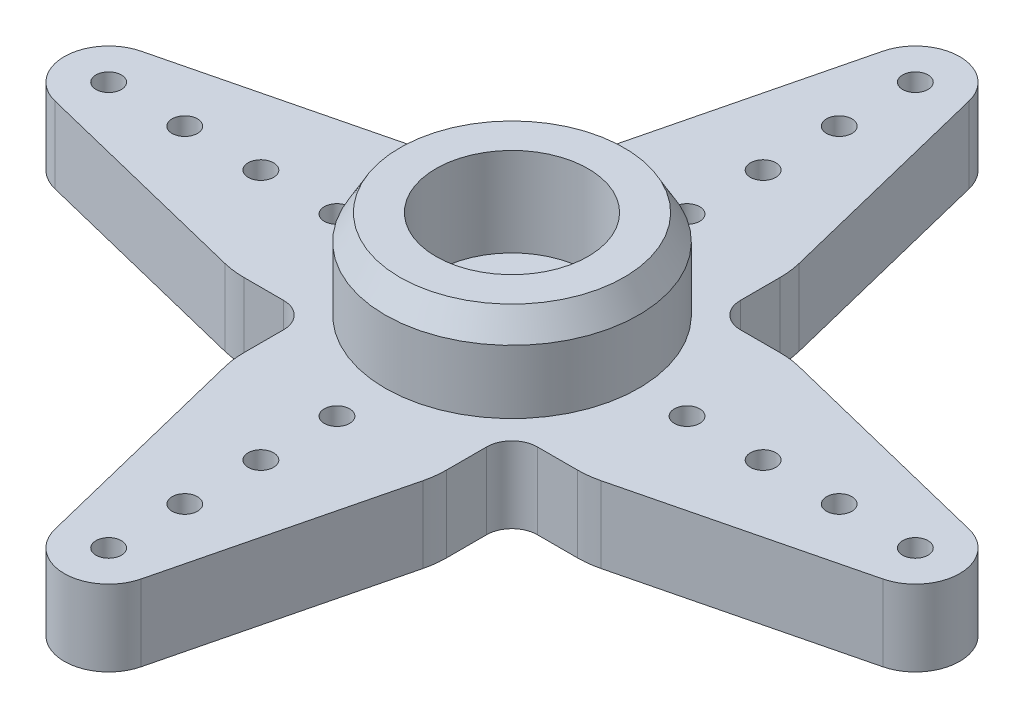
ISO-10303-21;
HEADER;
FILE_DESCRIPTION(('STEP AP214'),'2;1');
FILE_NAME('part.step','',(''),(''),'','','');
FILE_SCHEMA(('AUTOMOTIVE_DESIGN { 1 0 10303 214 1 1 1 1 }'));
ENDSEC;
DATA;
#1=APPLICATION_CONTEXT('core data for automotive mechanical design processes');
#2=APPLICATION_PROTOCOL_DEFINITION('international standard','automotive_design',2000,#1);
#3=PRODUCT_CONTEXT('',#1,'mechanical');
#4=PRODUCT('Part','Part','',(#3));
#5=PRODUCT_RELATED_PRODUCT_CATEGORY('part','',(#4));
#6=PRODUCT_DEFINITION_FORMATION('','',#4);
#7=PRODUCT_DEFINITION_CONTEXT('part definition',#1,'design');
#8=PRODUCT_DEFINITION('design','',#6,#7);
#9=PRODUCT_DEFINITION_SHAPE('','',#8);
#10=(LENGTH_UNIT() NAMED_UNIT(*) SI_UNIT(.MILLI.,.METRE.));
#11=(NAMED_UNIT(*) PLANE_ANGLE_UNIT() SI_UNIT($,.RADIAN.));
#12=(NAMED_UNIT(*) SI_UNIT($,.STERADIAN.) SOLID_ANGLE_UNIT());
#13=UNCERTAINTY_MEASURE_WITH_UNIT(LENGTH_MEASURE(1.E-05),#10,'distance_accuracy_value','');
#14=(GEOMETRIC_REPRESENTATION_CONTEXT(3) GLOBAL_UNCERTAINTY_ASSIGNED_CONTEXT((#13)) GLOBAL_UNIT_ASSIGNED_CONTEXT((#10,
#11,#12)) REPRESENTATION_CONTEXT('',''));
#15=CARTESIAN_POINT('',(0.,0.,0.));
#16=DIRECTION('',(0.,0.,1.));
#17=DIRECTION('',(1.,0.,0.));
#18=AXIS2_PLACEMENT_3D('',#15,#16,#17);
#19=CARTESIAN_POINT('',(0.,3.,0.));
#20=DIRECTION('',(0.,1.,0.));
#21=DIRECTION('',(0.,0.,1.));
#22=AXIS2_PLACEMENT_3D('',#19,#20,#21);
#23=PLANE('',#22);
#24=DIRECTION('',(-1.,0.,0.));
#25=VECTOR('',#24,1.);
#26=CARTESIAN_POINT('',(0.,3.,-4.));
#27=LINE('',#26,#25);
#28=CARTESIAN_POINT('',(6.5742936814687,3.,-3.99999999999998));
#29=VERTEX_POINT('',#28);
#30=CARTESIAN_POINT('',(5.,3.,-3.99999999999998));
#31=VERTEX_POINT('',#30);
#32=EDGE_CURVE('E256',#29,#31,#27,.T.);
#33=ORIENTED_EDGE('',*,*,#32,.T.);
#34=CARTESIAN_POINT('',(5.,3.,-4.99999999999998));
#35=DIRECTION('',(0.,1.,0.));
#36=DIRECTION('',(0.,0.,1.));
#37=AXIS2_PLACEMENT_3D('',#34,#35,#36);
#38=CIRCLE('',#37,1.);
#39=CARTESIAN_POINT('',(4.,3.,-4.99999999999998));
#40=VERTEX_POINT('',#39);
#41=EDGE_CURVE('E557',#31,#40,#38,.F.);
#42=ORIENTED_EDGE('',*,*,#41,.T.);
#43=DIRECTION('',(0.,0.,-1.));
#44=VECTOR('',#43,1.);
#45=CARTESIAN_POINT('',(4.,3.,-6.57429368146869));
#46=LINE('',#45,#44);
#47=CARTESIAN_POINT('',(4.,3.,-6.57429368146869));
#48=VERTEX_POINT('',#47);
#49=EDGE_CURVE('E481',#40,#48,#46,.T.);
#50=ORIENTED_EDGE('',*,*,#49,.T.);
#51=CARTESIAN_POINT('',(0.5,3.,-6.57429368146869));
#52=DIRECTION('',(0.,1.,0.));
#53=DIRECTION('',(0.,0.,-1.));
#54=AXIS2_PLACEMENT_3D('',#51,#52,#53);
#55=CIRCLE('',#54,3.5);
#56=CARTESIAN_POINT('',(3.89795205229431,3.,-7.41329418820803));
#57=VERTEX_POINT('',#56);
#58=EDGE_CURVE('E484',#48,#57,#55,.T.);
#59=ORIENTED_EDGE('',*,*,#58,.T.);
#60=DIRECTION('',(-0.239714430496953,0.,-0.970843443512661));
#61=VECTOR('',#60,1.);
#62=CARTESIAN_POINT('',(1.69897602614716,3.,-16.319147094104));
#63=LINE('',#62,#61);
#64=CARTESIAN_POINT('',(1.69897602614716,3.,-16.319147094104));
#65=VERTEX_POINT('',#64);
#66=EDGE_CURVE('E486',#57,#65,#63,.T.);
#67=ORIENTED_EDGE('',*,*,#66,.T.);
#68=CARTESIAN_POINT('',(0.,3.,-15.8996468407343));
#69=DIRECTION('',(0.,1.,0.));
#70=DIRECTION('',(0.,0.,-1.));
#71=AXIS2_PLACEMENT_3D('',#68,#69,#70);
#72=CIRCLE('',#71,1.75);
#73=CARTESIAN_POINT('',(-1.69897602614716,3.,-16.319147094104));
#74=VERTEX_POINT('',#73);
#75=EDGE_CURVE('E488',#65,#74,#72,.T.);
#76=ORIENTED_EDGE('',*,*,#75,.T.);
#77=DIRECTION('',(-0.239714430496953,0.,0.970843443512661));
#78=VECTOR('',#77,1.);
#79=CARTESIAN_POINT('',(-3.89795205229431,3.,-7.41329418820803));
#80=LINE('',#79,#78);
#81=CARTESIAN_POINT('',(-3.89795205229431,3.,-7.41329418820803));
#82=VERTEX_POINT('',#81);
#83=EDGE_CURVE('E490',#74,#82,#80,.T.);
#84=ORIENTED_EDGE('',*,*,#83,.T.);
#85=CARTESIAN_POINT('',(-0.5,3.,-6.57429368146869));
#86=DIRECTION('',(0.,1.,0.));
#87=DIRECTION('',(0.,0.,-1.));
#88=AXIS2_PLACEMENT_3D('',#85,#86,#87);
#89=CIRCLE('',#88,3.5);
#90=CARTESIAN_POINT('',(-4.,3.,-6.57429368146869));
#91=VERTEX_POINT('',#90);
#92=EDGE_CURVE('E492',#82,#91,#89,.T.);
#93=ORIENTED_EDGE('',*,*,#92,.T.);
#94=DIRECTION('',(0.,0.,1.));
#95=VECTOR('',#94,1.);
#96=CARTESIAN_POINT('',(-4.,3.,0.));
#97=LINE('',#96,#95);
#98=CARTESIAN_POINT('',(-4.,3.,-5.00000000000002));
#99=VERTEX_POINT('',#98);
#100=EDGE_CURVE('E494',#91,#99,#97,.T.);
#101=ORIENTED_EDGE('',*,*,#100,.T.);
#102=CARTESIAN_POINT('',(-5.,3.,-5.00000000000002));
#103=DIRECTION('',(0.,1.,0.));
#104=DIRECTION('',(0.,0.,1.));
#105=AXIS2_PLACEMENT_3D('',#102,#103,#104);
#106=CIRCLE('',#105,1.);
#107=CARTESIAN_POINT('',(-5.00000000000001,3.,-4.00000000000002));
#108=VERTEX_POINT('',#107);
#109=EDGE_CURVE('E252',#99,#108,#106,.F.);
#110=ORIENTED_EDGE('',*,*,#109,.T.);
#111=CARTESIAN_POINT('',(-6.57429368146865,3.,-4.00000000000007));
#112=VERTEX_POINT('',#111);
#113=EDGE_CURVE('E243',#108,#112,#27,.T.);
#114=ORIENTED_EDGE('',*,*,#113,.T.);
#115=CARTESIAN_POINT('',(-6.57429368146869,3.,-0.500000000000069));
#116=DIRECTION('',(0.,1.,0.));
#117=DIRECTION('',(-1.,0.,0.));
#118=AXIS2_PLACEMENT_3D('',#115,#116,#117);
#119=CIRCLE('',#118,3.5);
#120=CARTESIAN_POINT('',(-7.41329418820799,3.,-3.89795205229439));
#121=VERTEX_POINT('',#120);
#122=EDGE_CURVE('E248',#112,#121,#119,.T.);
#123=ORIENTED_EDGE('',*,*,#122,.T.);
#124=DIRECTION('',(-0.970843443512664,0.,0.239714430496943));
#125=VECTOR('',#124,1.);
#126=CARTESIAN_POINT('',(-16.319147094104,3.,-1.69897602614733));
#127=LINE('',#126,#125);
#128=CARTESIAN_POINT('',(-16.319147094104,3.,-1.69897602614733));
#129=VERTEX_POINT('',#128);
#130=EDGE_CURVE('E272',#121,#129,#127,.T.);
#131=ORIENTED_EDGE('',*,*,#130,.T.);
#132=CARTESIAN_POINT('',(-15.8996468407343,3.,-1.6653996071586E-13));
#133=DIRECTION('',(0.,1.,0.));
#134=DIRECTION('',(-1.,0.,0.));
#135=AXIS2_PLACEMENT_3D('',#132,#133,#134);
#136=CIRCLE('',#135,1.75);
#137=CARTESIAN_POINT('',(-16.319147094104,3.,1.69897602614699));
#138=VERTEX_POINT('',#137);
#139=EDGE_CURVE('E275',#129,#138,#136,.T.);
#140=ORIENTED_EDGE('',*,*,#139,.T.);
#141=DIRECTION('',(0.970843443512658,0.,0.239714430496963));
#142=VECTOR('',#141,1.);
#143=CARTESIAN_POINT('',(-7.41329418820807,3.,3.89795205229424));
#144=LINE('',#143,#142);
#145=CARTESIAN_POINT('',(-7.41329418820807,3.,3.89795205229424));
#146=VERTEX_POINT('',#145);
#147=EDGE_CURVE('E285',#138,#146,#144,.T.);
#148=ORIENTED_EDGE('',*,*,#147,.T.);
#149=CARTESIAN_POINT('',(-6.5742936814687,3.,0.499999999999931));
#150=DIRECTION('',(0.,1.,0.));
#151=DIRECTION('',(-1.,0.,0.));
#152=AXIS2_PLACEMENT_3D('',#149,#150,#151);
#153=CIRCLE('',#152,3.5);
#154=CARTESIAN_POINT('',(-6.57429368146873,3.,3.99999999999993));
#155=VERTEX_POINT('',#154);
#156=EDGE_CURVE('E287',#146,#155,#153,.T.);
#157=ORIENTED_EDGE('',*,*,#156,.T.);
#158=DIRECTION('',(1.,0.,0.));
#159=VECTOR('',#158,1.);
#160=CARTESIAN_POINT('',(0.,3.,4.));
#161=LINE('',#160,#159);
#162=CARTESIAN_POINT('',(-4.99999999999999,3.,3.99999999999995));
#163=VERTEX_POINT('',#162);
#164=EDGE_CURVE('E289',#155,#163,#161,.T.);
#165=ORIENTED_EDGE('',*,*,#164,.T.);
#166=CARTESIAN_POINT('',(-5.,3.,4.99999999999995));
#167=DIRECTION('',(0.,1.,0.));
#168=DIRECTION('',(0.,0.,1.));
#169=AXIS2_PLACEMENT_3D('',#166,#167,#168);
#170=CIRCLE('',#169,1.);
#171=CARTESIAN_POINT('',(-4.,3.,4.99999999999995));
#172=VERTEX_POINT('',#171);
#173=EDGE_CURVE('E564',#163,#172,#170,.F.);
#174=ORIENTED_EDGE('',*,*,#173,.T.);
#175=DIRECTION('',(0.,0.,1.));
#176=VECTOR('',#175,1.);
#177=CARTESIAN_POINT('',(-4.,3.,6.57429368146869));
#178=LINE('',#177,#176);
#179=CARTESIAN_POINT('',(-4.,3.,6.57429368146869));
#180=VERTEX_POINT('',#179);
#181=EDGE_CURVE('E339',#172,#180,#178,.T.);
#182=ORIENTED_EDGE('',*,*,#181,.T.);
#183=CARTESIAN_POINT('',(-0.5,3.,6.57429368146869));
#184=DIRECTION('',(0.,1.,0.));
#185=DIRECTION('',(0.,0.,1.));
#186=AXIS2_PLACEMENT_3D('',#183,#184,#185);
#187=CIRCLE('',#186,3.5);
#188=CARTESIAN_POINT('',(-3.89795205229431,3.,7.41329418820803));
#189=VERTEX_POINT('',#188);
#190=EDGE_CURVE('E341',#180,#189,#187,.T.);
#191=ORIENTED_EDGE('',*,*,#190,.T.);
#192=DIRECTION('',(0.239714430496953,0.,0.970843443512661));
#193=VECTOR('',#192,1.);
#194=CARTESIAN_POINT('',(-1.69897602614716,3.,16.319147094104));
#195=LINE('',#194,#193);
#196=CARTESIAN_POINT('',(-1.69897602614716,3.,16.319147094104));
#197=VERTEX_POINT('',#196);
#198=EDGE_CURVE('E344',#189,#197,#195,.T.);
#199=ORIENTED_EDGE('',*,*,#198,.T.);
#200=CARTESIAN_POINT('',(0.,3.,15.8996468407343));
#201=DIRECTION('',(0.,1.,0.));
#202=DIRECTION('',(0.,0.,1.));
#203=AXIS2_PLACEMENT_3D('',#200,#201,#202);
#204=CIRCLE('',#203,1.75);
#205=CARTESIAN_POINT('',(1.69897602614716,3.,16.319147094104));
#206=VERTEX_POINT('',#205);
#207=EDGE_CURVE('E346',#197,#206,#204,.T.);
#208=ORIENTED_EDGE('',*,*,#207,.T.);
#209=DIRECTION('',(0.239714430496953,0.,-0.970843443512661));
#210=VECTOR('',#209,1.);
#211=CARTESIAN_POINT('',(3.89795205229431,3.,7.41329418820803));
#212=LINE('',#211,#210);
#213=CARTESIAN_POINT('',(3.89795205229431,3.,7.41329418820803));
#214=VERTEX_POINT('',#213);
#215=EDGE_CURVE('E348',#206,#214,#212,.T.);
#216=ORIENTED_EDGE('',*,*,#215,.T.);
#217=CARTESIAN_POINT('',(0.5,3.,6.57429368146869));
#218=DIRECTION('',(0.,1.,0.));
#219=DIRECTION('',(0.,0.,1.));
#220=AXIS2_PLACEMENT_3D('',#217,#218,#219);
#221=CIRCLE('',#220,3.5);
#222=CARTESIAN_POINT('',(4.,3.,6.57429368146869));
#223=VERTEX_POINT('',#222);
#224=EDGE_CURVE('E350',#214,#223,#221,.T.);
#225=ORIENTED_EDGE('',*,*,#224,.T.);
#226=DIRECTION('',(0.,0.,-1.));
#227=VECTOR('',#226,1.);
#228=CARTESIAN_POINT('',(4.,3.,0.));
#229=LINE('',#228,#227);
#230=CARTESIAN_POINT('',(4.,3.,5.00000000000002));
#231=VERTEX_POINT('',#230);
#232=EDGE_CURVE('E352',#223,#231,#229,.T.);
#233=ORIENTED_EDGE('',*,*,#232,.T.);
#234=CARTESIAN_POINT('',(5.,3.,5.00000000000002));
#235=DIRECTION('',(0.,1.,0.));
#236=DIRECTION('',(0.,0.,1.));
#237=AXIS2_PLACEMENT_3D('',#234,#235,#236);
#238=CIRCLE('',#237,1.);
#239=CARTESIAN_POINT('',(5.00000000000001,3.,4.00000000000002));
#240=VERTEX_POINT('',#239);
#241=EDGE_CURVE('E46',#231,#240,#238,.F.);
#242=ORIENTED_EDGE('',*,*,#241,.T.);
#243=DIRECTION('',(1.,0.,0.));
#244=VECTOR('',#243,1.);
#245=CARTESIAN_POINT('',(6.57429368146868,3.,4.00000000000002));
#246=LINE('',#245,#244);
#247=CARTESIAN_POINT('',(6.57429368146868,3.,4.00000000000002));
#248=VERTEX_POINT('',#247);
#249=EDGE_CURVE('E410',#240,#248,#246,.T.);
#250=ORIENTED_EDGE('',*,*,#249,.T.);
#251=CARTESIAN_POINT('',(6.57429368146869,3.,0.500000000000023));
#252=DIRECTION('',(0.,1.,0.));
#253=DIRECTION('',(1.,0.,0.));
#254=AXIS2_PLACEMENT_3D('',#251,#252,#253);
#255=CIRCLE('',#254,3.5);
#256=CARTESIAN_POINT('',(7.41329418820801,3.,3.89795205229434));
#257=VERTEX_POINT('',#256);
#258=EDGE_CURVE('E412',#248,#257,#255,.T.);
#259=ORIENTED_EDGE('',*,*,#258,.T.);
#260=DIRECTION('',(0.970843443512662,0.,-0.23971443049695));
#261=VECTOR('',#260,1.);
#262=CARTESIAN_POINT('',(16.319147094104,3.,1.69897602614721));
#263=LINE('',#262,#261);
#264=CARTESIAN_POINT('',(16.319147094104,3.,1.69897602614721));
#265=VERTEX_POINT('',#264);
#266=EDGE_CURVE('E415',#257,#265,#263,.T.);
#267=ORIENTED_EDGE('',*,*,#266,.T.);
#268=CARTESIAN_POINT('',(15.8996468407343,3.,0.));
#269=DIRECTION('',(0.,1.,0.));
#270=DIRECTION('',(1.,0.,0.));
#271=AXIS2_PLACEMENT_3D('',#268,#269,#270);
#272=CIRCLE('',#271,1.75);
#273=CARTESIAN_POINT('',(16.319147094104,3.,-1.6989760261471));
#274=VERTEX_POINT('',#273);
#275=EDGE_CURVE('E417',#265,#274,#272,.T.);
#276=ORIENTED_EDGE('',*,*,#275,.T.);
#277=DIRECTION('',(-0.97084344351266,0.,-0.239714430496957));
#278=VECTOR('',#277,1.);
#279=CARTESIAN_POINT('',(7.41329418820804,3.,-3.89795205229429));
#280=LINE('',#279,#278);
#281=CARTESIAN_POINT('',(7.41329418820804,3.,-3.89795205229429));
#282=VERTEX_POINT('',#281);
#283=EDGE_CURVE('E419',#274,#282,#280,.T.);
#284=ORIENTED_EDGE('',*,*,#283,.T.);
#285=CARTESIAN_POINT('',(6.57429368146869,3.,-0.499999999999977));
#286=DIRECTION('',(0.,1.,0.));
#287=DIRECTION('',(1.,0.,0.));
#288=AXIS2_PLACEMENT_3D('',#285,#286,#287);
#289=CIRCLE('',#288,3.5);
#290=EDGE_CURVE('E257',#282,#29,#289,.T.);
#291=ORIENTED_EDGE('',*,*,#290,.T.);
#292=EDGE_LOOP('',(#33,#42,#50,#59,#67,#76,#84,#93,#101,#110,#114,#123,#131,#140,#148,#157,#165,
#174,#182,#191,#199,#208,#216,#225,#233,#242,#250,#259,#267,#276,#284,#291));
#293=FACE_BOUND('',#292,.T.);
#294=CARTESIAN_POINT('',(9.89964684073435,3.,0.));
#295=DIRECTION('',(0.,1.,0.));
#296=DIRECTION('',(-1.,0.,0.));
#297=AXIS2_PLACEMENT_3D('',#294,#295,#296);
#298=CIRCLE('',#297,0.500000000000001);
#299=CARTESIAN_POINT('',(9.39964684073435,3.,0.));
#300=VERTEX_POINT('',#299);
#301=EDGE_CURVE('E392',#300,#300,#298,.T.);
#302=ORIENTED_EDGE('',*,*,#301,.F.);
#303=EDGE_LOOP('',(#302));
#304=FACE_BOUND('',#303,.T.);
#305=CARTESIAN_POINT('',(15.8996468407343,3.,0.));
#306=DIRECTION('',(0.,1.,0.));
#307=DIRECTION('',(-1.,0.,0.));
#308=AXIS2_PLACEMENT_3D('',#305,#306,#307);
#309=CIRCLE('',#308,0.500000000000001);
#310=CARTESIAN_POINT('',(15.3996468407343,3.,0.));
#311=VERTEX_POINT('',#310);
#312=EDGE_CURVE('E404',#311,#311,#309,.T.);
#313=ORIENTED_EDGE('',*,*,#312,.F.);
#314=EDGE_LOOP('',(#313));
#315=FACE_BOUND('',#314,.T.);
#316=CARTESIAN_POINT('',(12.8996468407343,3.,0.));
#317=DIRECTION('',(0.,1.,0.));
#318=DIRECTION('',(-1.,0.,0.));
#319=AXIS2_PLACEMENT_3D('',#316,#317,#318);
#320=CIRCLE('',#319,0.500000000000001);
#321=CARTESIAN_POINT('',(12.3996468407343,3.,0.));
#322=VERTEX_POINT('',#321);
#323=EDGE_CURVE('E398',#322,#322,#320,.T.);
#324=ORIENTED_EDGE('',*,*,#323,.F.);
#325=EDGE_LOOP('',(#324));
#326=FACE_BOUND('',#325,.T.);
#327=CARTESIAN_POINT('',(6.89964684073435,3.,1.18359984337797E-13));
#328=DIRECTION('',(0.,1.,0.));
#329=DIRECTION('',(-1.,0.,0.));
#330=AXIS2_PLACEMENT_3D('',#327,#328,#329);
#331=CIRCLE('',#330,0.500000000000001);
#332=CARTESIAN_POINT('',(6.39964684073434,3.,1.16614243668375E-13));
#333=VERTEX_POINT('',#332);
#334=EDGE_CURVE('E386',#333,#333,#331,.T.);
#335=ORIENTED_EDGE('',*,*,#334,.F.);
#336=EDGE_LOOP('',(#335));
#337=FACE_BOUND('',#336,.T.);
#338=CARTESIAN_POINT('',(-6.89964684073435,3.,-1.6653996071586E-13));
#339=DIRECTION('',(0.,1.,0.));
#340=DIRECTION('',(1.,0.,0.));
#341=AXIS2_PLACEMENT_3D('',#338,#339,#340);
#342=CIRCLE('',#341,0.500000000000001);
#343=CARTESIAN_POINT('',(-6.39964684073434,3.,-1.61302738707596E-13));
#344=VERTEX_POINT('',#343);
#345=EDGE_CURVE('E1232',#344,#344,#342,.T.);
#346=ORIENTED_EDGE('',*,*,#345,.F.);
#347=EDGE_LOOP('',(#346));
#348=FACE_BOUND('',#347,.T.);
#349=CARTESIAN_POINT('',(-12.8996468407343,3.,-1.6653996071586E-13));
#350=DIRECTION('',(0.,1.,0.));
#351=DIRECTION('',(1.,0.,0.));
#352=AXIS2_PLACEMENT_3D('',#349,#350,#351);
#353=CIRCLE('',#352,0.500000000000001);
#354=CARTESIAN_POINT('',(-12.3996468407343,3.,-1.61302738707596E-13));
#355=VERTEX_POINT('',#354);
#356=EDGE_CURVE('E1246',#355,#355,#353,.T.);
#357=ORIENTED_EDGE('',*,*,#356,.F.);
#358=EDGE_LOOP('',(#357));
#359=FACE_BOUND('',#358,.T.);
#360=CARTESIAN_POINT('',(-15.8996468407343,3.,-1.6653996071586E-13));
#361=DIRECTION('',(0.,1.,0.));
#362=DIRECTION('',(1.,0.,0.));
#363=AXIS2_PLACEMENT_3D('',#360,#361,#362);
#364=CIRCLE('',#363,0.500000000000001);
#365=CARTESIAN_POINT('',(-15.3996468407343,3.,-1.61302738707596E-13));
#366=VERTEX_POINT('',#365);
#367=EDGE_CURVE('E296',#366,#366,#364,.T.);
#368=ORIENTED_EDGE('',*,*,#367,.F.);
#369=EDGE_LOOP('',(#368));
#370=FACE_BOUND('',#369,.T.);
#371=CARTESIAN_POINT('',(-9.89964684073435,3.,-1.6653996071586E-13));
#372=DIRECTION('',(0.,1.,0.));
#373=DIRECTION('',(1.,0.,0.));
#374=AXIS2_PLACEMENT_3D('',#371,#372,#373);
#375=CIRCLE('',#374,0.500000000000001);
#376=CARTESIAN_POINT('',(-9.39964684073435,3.,-1.61302738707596E-13));
#377=VERTEX_POINT('',#376);
#378=EDGE_CURVE('E1240',#377,#377,#375,.T.);
#379=ORIENTED_EDGE('',*,*,#378,.F.);
#380=EDGE_LOOP('',(#379));
#381=FACE_BOUND('',#380,.T.);
#382=CARTESIAN_POINT('',(0.,3.,6.89964684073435));
#383=DIRECTION('',(0.,1.,0.));
#384=DIRECTION('',(0.,0.,-1.));
#385=AXIS2_PLACEMENT_3D('',#382,#383,#384);
#386=CIRCLE('',#385,0.500000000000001);
#387=CARTESIAN_POINT('',(0.,3.,6.39964684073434));
#388=VERTEX_POINT('',#387);
#389=EDGE_CURVE('E315',#388,#388,#386,.T.);
#390=ORIENTED_EDGE('',*,*,#389,.F.);
#391=EDGE_LOOP('',(#390));
#392=FACE_BOUND('',#391,.T.);
#393=CARTESIAN_POINT('',(0.,3.,12.8996468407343));
#394=DIRECTION('',(0.,1.,0.));
#395=DIRECTION('',(0.,0.,-1.));
#396=AXIS2_PLACEMENT_3D('',#393,#394,#395);
#397=CIRCLE('',#396,0.500000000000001);
#398=CARTESIAN_POINT('',(0.,3.,12.3996468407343));
#399=VERTEX_POINT('',#398);
#400=EDGE_CURVE('E327',#399,#399,#397,.T.);
#401=ORIENTED_EDGE('',*,*,#400,.F.);
#402=EDGE_LOOP('',(#401));
#403=FACE_BOUND('',#402,.T.);
#404=CARTESIAN_POINT('',(0.,3.,15.8996468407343));
#405=DIRECTION('',(0.,1.,0.));
#406=DIRECTION('',(0.,0.,-1.));
#407=AXIS2_PLACEMENT_3D('',#404,#405,#406);
#408=CIRCLE('',#407,0.500000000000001);
#409=CARTESIAN_POINT('',(0.,3.,15.3996468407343));
#410=VERTEX_POINT('',#409);
#411=EDGE_CURVE('E333',#410,#410,#408,.T.);
#412=ORIENTED_EDGE('',*,*,#411,.F.);
#413=EDGE_LOOP('',(#412));
#414=FACE_BOUND('',#413,.T.);
#415=CARTESIAN_POINT('',(0.,3.,9.89964684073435));
#416=DIRECTION('',(0.,1.,0.));
#417=DIRECTION('',(0.,0.,-1.));
#418=AXIS2_PLACEMENT_3D('',#415,#416,#417);
#419=CIRCLE('',#418,0.500000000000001);
#420=CARTESIAN_POINT('',(0.,3.,9.39964684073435));
#421=VERTEX_POINT('',#420);
#422=EDGE_CURVE('E321',#421,#421,#419,.T.);
#423=ORIENTED_EDGE('',*,*,#422,.F.);
#424=EDGE_LOOP('',(#423));
#425=FACE_BOUND('',#424,.T.);
#426=CARTESIAN_POINT('',(0.,3.,-6.89964684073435));
#427=DIRECTION('',(0.,1.,0.));
#428=DIRECTION('',(0.,0.,1.));
#429=AXIS2_PLACEMENT_3D('',#426,#427,#428);
#430=CIRCLE('',#429,0.500000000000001);
#431=CARTESIAN_POINT('',(0.,3.,-6.39964684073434));
#432=VERTEX_POINT('',#431);
#433=EDGE_CURVE('E454',#432,#432,#430,.T.);
#434=ORIENTED_EDGE('',*,*,#433,.F.);
#435=EDGE_LOOP('',(#434));
#436=FACE_BOUND('',#435,.T.);
#437=CARTESIAN_POINT('',(0.,3.,-12.8996468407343));
#438=DIRECTION('',(0.,1.,0.));
#439=DIRECTION('',(0.,0.,1.));
#440=AXIS2_PLACEMENT_3D('',#437,#438,#439);
#441=CIRCLE('',#440,0.500000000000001);
#442=CARTESIAN_POINT('',(0.,3.,-12.3996468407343));
#443=VERTEX_POINT('',#442);
#444=EDGE_CURVE('E466',#443,#443,#441,.T.);
#445=ORIENTED_EDGE('',*,*,#444,.F.);
#446=EDGE_LOOP('',(#445));
#447=FACE_BOUND('',#446,.T.);
#448=CARTESIAN_POINT('',(0.,3.,-15.8996468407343));
#449=DIRECTION('',(0.,1.,0.));
#450=DIRECTION('',(0.,0.,1.));
#451=AXIS2_PLACEMENT_3D('',#448,#449,#450);
#452=CIRCLE('',#451,0.500000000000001);
#453=CARTESIAN_POINT('',(0.,3.,-15.3996468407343));
#454=VERTEX_POINT('',#453);
#455=EDGE_CURVE('E472',#454,#454,#452,.T.);
#456=ORIENTED_EDGE('',*,*,#455,.F.);
#457=EDGE_LOOP('',(#456));
#458=FACE_BOUND('',#457,.T.);
#459=CARTESIAN_POINT('',(0.,3.,-9.89964684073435));
#460=DIRECTION('',(0.,1.,0.));
#461=DIRECTION('',(0.,0.,1.));
#462=AXIS2_PLACEMENT_3D('',#459,#460,#461);
#463=CIRCLE('',#462,0.500000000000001);
#464=CARTESIAN_POINT('',(0.,3.,-9.39964684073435));
#465=VERTEX_POINT('',#464);
#466=EDGE_CURVE('E460',#465,#465,#463,.T.);
#467=ORIENTED_EDGE('',*,*,#466,.F.);
#468=EDGE_LOOP('',(#467));
#469=FACE_BOUND('',#468,.T.);
#470=CARTESIAN_POINT('',(0.,3.,0.));
#471=DIRECTION('',(0.,1.,0.));
#472=DIRECTION('',(0.,0.,1.));
#473=AXIS2_PLACEMENT_3D('',#470,#471,#472);
#474=CIRCLE('',#473,5.);
#475=CARTESIAN_POINT('',(0.,3.,5.));
#476=VERTEX_POINT('',#475);
#477=EDGE_CURVE('E1226',#476,#476,#474,.T.);
#478=ORIENTED_EDGE('',*,*,#477,.F.);
#479=EDGE_LOOP('',(#478));
#480=FACE_BOUND('',#479,.T.);
#481=ADVANCED_FACE('F38',(#293,#304,#315,#326,#337,#348,#359,#370,#381,#392,#403,#414,#425,#436,
#447,#458,#469,#480),#23,.T.);
#482=CARTESIAN_POINT('',(4.,3.,-6.57429368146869));
#483=DIRECTION('',(-1.,0.,0.));
#484=DIRECTION('',(0.,0.,1.));
#485=AXIS2_PLACEMENT_3D('',#482,#483,#484);
#486=PLANE('',#485);
#487=ORIENTED_EDGE('',*,*,#49,.F.);
#488=DIRECTION('',(0.,1.,0.));
#489=VECTOR('',#488,1.);
#490=CARTESIAN_POINT('',(4.,0.,-4.99999999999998));
#491=LINE('',#490,#489);
#492=CARTESIAN_POINT('',(4.,0.,-4.99999999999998));
#493=VERTEX_POINT('',#492);
#494=EDGE_CURVE('E542',#40,#493,#491,.F.);
#495=ORIENTED_EDGE('',*,*,#494,.T.);
#496=DIRECTION('',(0.,0.,-1.));
#497=VECTOR('',#496,1.);
#498=CARTESIAN_POINT('',(4.,0.,-6.57429368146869));
#499=LINE('',#498,#497);
#500=CARTESIAN_POINT('',(4.,0.,-6.57429368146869));
#501=VERTEX_POINT('',#500);
#502=EDGE_CURVE('E499',#493,#501,#499,.T.);
#503=ORIENTED_EDGE('',*,*,#502,.T.);
#504=DIRECTION('',(0.,-1.,0.));
#505=VECTOR('',#504,1.);
#506=CARTESIAN_POINT('',(4.,3.,-6.57429368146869));
#507=LINE('',#506,#505);
#508=EDGE_CURVE('E527',#48,#501,#507,.T.);
#509=ORIENTED_EDGE('',*,*,#508,.F.);
#510=EDGE_LOOP('',(#487,#495,#503,#509));
#511=FACE_BOUND('',#510,.T.);
#512=ADVANCED_FACE('F657',(#511),#486,.F.);
#513=CARTESIAN_POINT('',(-4.,3.,0.));
#514=DIRECTION('',(1.,0.,0.));
#515=DIRECTION('',(0.,0.,-1.));
#516=AXIS2_PLACEMENT_3D('',#513,#514,#515);
#517=PLANE('',#516);
#518=DIRECTION('',(0.,0.,1.));
#519=VECTOR('',#518,1.);
#520=CARTESIAN_POINT('',(-4.,0.,0.));
#521=LINE('',#520,#519);
#522=CARTESIAN_POINT('',(-4.,0.,-6.57429368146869));
#523=VERTEX_POINT('',#522);
#524=CARTESIAN_POINT('',(-4.,0.,-5.00000000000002));
#525=VERTEX_POINT('',#524);
#526=EDGE_CURVE('E482',#523,#525,#521,.T.);
#527=ORIENTED_EDGE('',*,*,#526,.T.);
#528=DIRECTION('',(0.,-1.,0.));
#529=VECTOR('',#528,1.);
#530=CARTESIAN_POINT('',(-4.,3.,-5.00000000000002));
#531=LINE('',#530,#529);
#532=EDGE_CURVE('E546',#525,#99,#531,.F.);
#533=ORIENTED_EDGE('',*,*,#532,.T.);
#534=ORIENTED_EDGE('',*,*,#100,.F.);
#535=DIRECTION('',(0.,-1.,0.));
#536=VECTOR('',#535,1.);
#537=CARTESIAN_POINT('',(-4.,3.,-6.57429368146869));
#538=LINE('',#537,#536);
#539=EDGE_CURVE('E496',#91,#523,#538,.T.);
#540=ORIENTED_EDGE('',*,*,#539,.T.);
#541=EDGE_LOOP('',(#527,#533,#534,#540));
#542=FACE_BOUND('',#541,.T.);
#543=ADVANCED_FACE('F687',(#542),#517,.F.);
#544=CARTESIAN_POINT('',(0.,3.,0.));
#545=DIRECTION('',(0.,1.,0.));
#546=DIRECTION('',(0.,0.,1.));
#547=AXIS2_PLACEMENT_3D('',#544,#545,#546);
#548=CIRCLE('',#547,3.);
#549=CARTESIAN_POINT('',(0.,3.,3.));
#550=VERTEX_POINT('',#549);
#551=EDGE_CURVE('E530',#550,#550,#548,.F.);
#552=ORIENTED_EDGE('',*,*,#551,.F.);
#553=EDGE_LOOP('',(#552));
#554=FACE_BOUND('',#553,.T.);
#555=CARTESIAN_POINT('',(0.,3.,0.));
#556=DIRECTION('',(0.,-1.,0.));
#557=DIRECTION('',(0.,0.,1.));
#558=AXIS2_PLACEMENT_3D('',#555,#556,#557);
#559=CIRCLE('',#558,1.25);
#560=CARTESIAN_POINT('',(0.,3.,1.25));
#561=VERTEX_POINT('',#560);
#562=EDGE_CURVE('E478',#561,#561,#559,.T.);
#563=ORIENTED_EDGE('',*,*,#562,.T.);
#564=EDGE_LOOP('',(#563));
#565=FACE_BOUND('',#564,.T.);
#566=ADVANCED_FACE('F722',(#554,#565),#23,.T.);
#567=CARTESIAN_POINT('',(0.,0.,0.));
#568=DIRECTION('',(0.,1.,0.));
#569=DIRECTION('',(0.,0.,1.));
#570=AXIS2_PLACEMENT_3D('',#567,#568,#569);
#571=PLANE('',#570);
#572=CARTESIAN_POINT('',(0.,0.,0.));
#573=DIRECTION('',(0.,-1.,0.));
#574=DIRECTION('',(0.,0.,1.));
#575=AXIS2_PLACEMENT_3D('',#572,#573,#574);
#576=CIRCLE('',#575,1.25);
#577=CARTESIAN_POINT('',(0.,0.,1.25));
#578=VERTEX_POINT('',#577);
#579=EDGE_CURVE('E475',#578,#578,#576,.T.);
#580=ORIENTED_EDGE('',*,*,#579,.F.);
#581=EDGE_LOOP('',(#580));
#582=FACE_BOUND('',#581,.T.);
#583=DIRECTION('',(-1.,0.,0.));
#584=VECTOR('',#583,1.);
#585=CARTESIAN_POINT('',(0.,0.,-4.));
#586=LINE('',#585,#584);
#587=CARTESIAN_POINT('',(-5.00000000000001,0.,-4.00000000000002));
#588=VERTEX_POINT('',#587);
#589=CARTESIAN_POINT('',(-6.57429368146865,0.,-4.00000000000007));
#590=VERTEX_POINT('',#589);
#591=EDGE_CURVE('E263',#588,#590,#586,.T.);
#592=ORIENTED_EDGE('',*,*,#591,.F.);
#593=CARTESIAN_POINT('',(-5.,0.,-5.00000000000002));
#594=DIRECTION('',(0.,1.,0.));
#595=DIRECTION('',(0.,0.,1.));
#596=AXIS2_PLACEMENT_3D('',#593,#594,#595);
#597=CIRCLE('',#596,1.);
#598=EDGE_CURVE('E561',#588,#525,#597,.T.);
#599=ORIENTED_EDGE('',*,*,#598,.T.);
#600=ORIENTED_EDGE('',*,*,#526,.F.);
#601=CARTESIAN_POINT('',(-0.5,0.,-6.57429368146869));
#602=DIRECTION('',(0.,1.,0.));
#603=DIRECTION('',(0.,0.,-1.));
#604=AXIS2_PLACEMENT_3D('',#601,#602,#603);
#605=CIRCLE('',#604,3.5);
#606=CARTESIAN_POINT('',(-3.89795205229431,0.,-7.41329418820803));
#607=VERTEX_POINT('',#606);
#608=EDGE_CURVE('E509',#607,#523,#605,.T.);
#609=ORIENTED_EDGE('',*,*,#608,.F.);
#610=DIRECTION('',(-0.239714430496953,0.,0.970843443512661));
#611=VECTOR('',#610,1.);
#612=CARTESIAN_POINT('',(-3.89795205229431,0.,-7.41329418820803));
#613=LINE('',#612,#611);
#614=CARTESIAN_POINT('',(-1.69897602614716,0.,-16.319147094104));
#615=VERTEX_POINT('',#614);
#616=EDGE_CURVE('E507',#615,#607,#613,.T.);
#617=ORIENTED_EDGE('',*,*,#616,.F.);
#618=CARTESIAN_POINT('',(0.,0.,-15.8996468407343));
#619=DIRECTION('',(0.,1.,0.));
#620=DIRECTION('',(0.,0.,-1.));
#621=AXIS2_PLACEMENT_3D('',#618,#619,#620);
#622=CIRCLE('',#621,1.75);
#623=CARTESIAN_POINT('',(1.69897602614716,0.,-16.319147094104));
#624=VERTEX_POINT('',#623);
#625=EDGE_CURVE('E505',#624,#615,#622,.T.);
#626=ORIENTED_EDGE('',*,*,#625,.F.);
#627=DIRECTION('',(-0.239714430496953,0.,-0.970843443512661));
#628=VECTOR('',#627,1.);
#629=CARTESIAN_POINT('',(1.69897602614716,0.,-16.319147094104));
#630=LINE('',#629,#628);
#631=CARTESIAN_POINT('',(3.89795205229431,0.,-7.41329418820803));
#632=VERTEX_POINT('',#631);
#633=EDGE_CURVE('E503',#632,#624,#630,.T.);
#634=ORIENTED_EDGE('',*,*,#633,.F.);
#635=CARTESIAN_POINT('',(0.5,0.,-6.57429368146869));
#636=DIRECTION('',(0.,1.,0.));
#637=DIRECTION('',(0.,0.,-1.));
#638=AXIS2_PLACEMENT_3D('',#635,#636,#637);
#639=CIRCLE('',#638,3.5);
#640=EDGE_CURVE('E501',#501,#632,#639,.T.);
#641=ORIENTED_EDGE('',*,*,#640,.F.);
#642=ORIENTED_EDGE('',*,*,#502,.F.);
#643=CARTESIAN_POINT('',(5.,0.,-4.99999999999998));
#644=DIRECTION('',(0.,1.,0.));
#645=DIRECTION('',(0.,0.,1.));
#646=AXIS2_PLACEMENT_3D('',#643,#644,#645);
#647=CIRCLE('',#646,1.);
#648=CARTESIAN_POINT('',(5.,0.,-3.99999999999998));
#649=VERTEX_POINT('',#648);
#650=EDGE_CURVE('E559',#493,#649,#647,.T.);
#651=ORIENTED_EDGE('',*,*,#650,.T.);
#652=CARTESIAN_POINT('',(6.5742936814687,0.,-3.99999999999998));
#653=VERTEX_POINT('',#652);
#654=EDGE_CURVE('E413',#653,#649,#586,.T.);
#655=ORIENTED_EDGE('',*,*,#654,.F.);
#656=CARTESIAN_POINT('',(6.57429368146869,0.,-0.499999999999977));
#657=DIRECTION('',(0.,1.,0.));
#658=DIRECTION('',(1.,0.,0.));
#659=AXIS2_PLACEMENT_3D('',#656,#657,#658);
#660=CIRCLE('',#659,3.5);
#661=CARTESIAN_POINT('',(7.41329418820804,0.,-3.89795205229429));
#662=VERTEX_POINT('',#661);
#663=EDGE_CURVE('E432',#662,#653,#660,.T.);
#664=ORIENTED_EDGE('',*,*,#663,.F.);
#665=DIRECTION('',(-0.97084344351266,0.,-0.239714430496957));
#666=VECTOR('',#665,1.);
#667=CARTESIAN_POINT('',(7.41329418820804,0.,-3.89795205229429));
#668=LINE('',#667,#666);
#669=CARTESIAN_POINT('',(16.319147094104,0.,-1.6989760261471));
#670=VERTEX_POINT('',#669);
#671=EDGE_CURVE('E430',#670,#662,#668,.T.);
#672=ORIENTED_EDGE('',*,*,#671,.F.);
#673=CARTESIAN_POINT('',(15.8996468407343,0.,0.));
#674=DIRECTION('',(0.,1.,0.));
#675=DIRECTION('',(1.,0.,0.));
#676=AXIS2_PLACEMENT_3D('',#673,#674,#675);
#677=CIRCLE('',#676,1.75);
#678=CARTESIAN_POINT('',(16.319147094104,0.,1.69897602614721));
#679=VERTEX_POINT('',#678);
#680=EDGE_CURVE('E428',#679,#670,#677,.T.);
#681=ORIENTED_EDGE('',*,*,#680,.F.);
#682=DIRECTION('',(0.970843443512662,0.,-0.23971443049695));
#683=VECTOR('',#682,1.);
#684=CARTESIAN_POINT('',(16.319147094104,0.,1.69897602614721));
#685=LINE('',#684,#683);
#686=CARTESIAN_POINT('',(7.41329418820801,0.,3.89795205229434));
#687=VERTEX_POINT('',#686);
#688=EDGE_CURVE('E426',#687,#679,#685,.T.);
#689=ORIENTED_EDGE('',*,*,#688,.F.);
#690=CARTESIAN_POINT('',(6.57429368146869,0.,0.500000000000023));
#691=DIRECTION('',(0.,1.,0.));
#692=DIRECTION('',(1.,0.,0.));
#693=AXIS2_PLACEMENT_3D('',#690,#691,#692);
#694=CIRCLE('',#693,3.5);
#695=CARTESIAN_POINT('',(6.57429368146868,0.,4.00000000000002));
#696=VERTEX_POINT('',#695);
#697=EDGE_CURVE('E424',#696,#687,#694,.T.);
#698=ORIENTED_EDGE('',*,*,#697,.F.);
#699=DIRECTION('',(1.,0.,0.));
#700=VECTOR('',#699,1.);
#701=CARTESIAN_POINT('',(6.57429368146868,0.,4.00000000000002));
#702=LINE('',#701,#700);
#703=CARTESIAN_POINT('',(5.00000000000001,0.,4.00000000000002));
#704=VERTEX_POINT('',#703);
#705=EDGE_CURVE('E407',#704,#696,#702,.T.);
#706=ORIENTED_EDGE('',*,*,#705,.F.);
#707=CARTESIAN_POINT('',(5.,0.,5.00000000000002));
#708=DIRECTION('',(0.,1.,0.));
#709=DIRECTION('',(0.,0.,1.));
#710=AXIS2_PLACEMENT_3D('',#707,#708,#709);
#711=CIRCLE('',#710,1.);
#712=CARTESIAN_POINT('',(4.,0.,5.00000000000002));
#713=VERTEX_POINT('',#712);
#714=EDGE_CURVE('E11',#704,#713,#711,.T.);
#715=ORIENTED_EDGE('',*,*,#714,.T.);
#716=DIRECTION('',(0.,0.,-1.));
#717=VECTOR('',#716,1.);
#718=CARTESIAN_POINT('',(4.,0.,0.));
#719=LINE('',#718,#717);
#720=CARTESIAN_POINT('',(4.,0.,6.57429368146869));
#721=VERTEX_POINT('',#720);
#722=EDGE_CURVE('E342',#721,#713,#719,.T.);
#723=ORIENTED_EDGE('',*,*,#722,.F.);
#724=CARTESIAN_POINT('',(0.5,0.,6.57429368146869));
#725=DIRECTION('',(0.,1.,0.));
#726=DIRECTION('',(0.,0.,1.));
#727=AXIS2_PLACEMENT_3D('',#724,#725,#726);
#728=CIRCLE('',#727,3.5);
#729=CARTESIAN_POINT('',(3.89795205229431,0.,7.41329418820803));
#730=VERTEX_POINT('',#729);
#731=EDGE_CURVE('E364',#730,#721,#728,.T.);
#732=ORIENTED_EDGE('',*,*,#731,.F.);
#733=DIRECTION('',(0.239714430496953,0.,-0.970843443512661));
#734=VECTOR('',#733,1.);
#735=CARTESIAN_POINT('',(3.89795205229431,0.,7.41329418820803));
#736=LINE('',#735,#734);
#737=CARTESIAN_POINT('',(1.69897602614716,0.,16.319147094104));
#738=VERTEX_POINT('',#737);
#739=EDGE_CURVE('E362',#738,#730,#736,.T.);
#740=ORIENTED_EDGE('',*,*,#739,.F.);
#741=CARTESIAN_POINT('',(0.,0.,15.8996468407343));
#742=DIRECTION('',(0.,1.,0.));
#743=DIRECTION('',(0.,0.,1.));
#744=AXIS2_PLACEMENT_3D('',#741,#742,#743);
#745=CIRCLE('',#744,1.75);
#746=CARTESIAN_POINT('',(-1.69897602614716,0.,16.319147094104));
#747=VERTEX_POINT('',#746);
#748=EDGE_CURVE('E360',#747,#738,#745,.T.);
#749=ORIENTED_EDGE('',*,*,#748,.F.);
#750=DIRECTION('',(0.239714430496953,0.,0.970843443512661));
#751=VECTOR('',#750,1.);
#752=CARTESIAN_POINT('',(-1.69897602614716,0.,16.319147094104));
#753=LINE('',#752,#751);
#754=CARTESIAN_POINT('',(-3.89795205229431,0.,7.41329418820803));
#755=VERTEX_POINT('',#754);
#756=EDGE_CURVE('E358',#755,#747,#753,.T.);
#757=ORIENTED_EDGE('',*,*,#756,.F.);
#758=CARTESIAN_POINT('',(-0.5,0.,6.57429368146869));
#759=DIRECTION('',(0.,1.,0.));
#760=DIRECTION('',(0.,0.,1.));
#761=AXIS2_PLACEMENT_3D('',#758,#759,#760);
#762=CIRCLE('',#761,3.5);
#763=CARTESIAN_POINT('',(-4.,0.,6.57429368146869));
#764=VERTEX_POINT('',#763);
#765=EDGE_CURVE('E356',#764,#755,#762,.T.);
#766=ORIENTED_EDGE('',*,*,#765,.F.);
#767=DIRECTION('',(0.,0.,1.));
#768=VECTOR('',#767,1.);
#769=CARTESIAN_POINT('',(-4.,0.,6.57429368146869));
#770=LINE('',#769,#768);
#771=CARTESIAN_POINT('',(-4.,0.,4.99999999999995));
#772=VERTEX_POINT('',#771);
#773=EDGE_CURVE('E336',#772,#764,#770,.T.);
#774=ORIENTED_EDGE('',*,*,#773,.F.);
#775=CARTESIAN_POINT('',(-5.,0.,4.99999999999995));
#776=DIRECTION('',(0.,1.,0.));
#777=DIRECTION('',(0.,0.,1.));
#778=AXIS2_PLACEMENT_3D('',#775,#776,#777);
#779=CIRCLE('',#778,1.);
#780=CARTESIAN_POINT('',(-4.99999999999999,0.,3.99999999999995));
#781=VERTEX_POINT('',#780);
#782=EDGE_CURVE('E566',#772,#781,#779,.T.);
#783=ORIENTED_EDGE('',*,*,#782,.T.);
#784=DIRECTION('',(1.,0.,0.));
#785=VECTOR('',#784,1.);
#786=CARTESIAN_POINT('',(0.,0.,4.));
#787=LINE('',#786,#785);
#788=CARTESIAN_POINT('',(-6.57429368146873,0.,3.99999999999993));
#789=VERTEX_POINT('',#788);
#790=EDGE_CURVE('E273',#789,#781,#787,.T.);
#791=ORIENTED_EDGE('',*,*,#790,.F.);
#792=CARTESIAN_POINT('',(-6.5742936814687,0.,0.499999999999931));
#793=DIRECTION('',(0.,1.,0.));
#794=DIRECTION('',(-1.,0.,0.));
#795=AXIS2_PLACEMENT_3D('',#792,#793,#794);
#796=CIRCLE('',#795,3.5);
#797=CARTESIAN_POINT('',(-7.41329418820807,0.,3.89795205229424));
#798=VERTEX_POINT('',#797);
#799=EDGE_CURVE('E278',#798,#789,#796,.T.);
#800=ORIENTED_EDGE('',*,*,#799,.F.);
#801=DIRECTION('',(0.970843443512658,0.,0.239714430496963));
#802=VECTOR('',#801,1.);
#803=CARTESIAN_POINT('',(-7.41329418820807,0.,3.89795205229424));
#804=LINE('',#803,#802);
#805=CARTESIAN_POINT('',(-16.319147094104,0.,1.69897602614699));
#806=VERTEX_POINT('',#805);
#807=EDGE_CURVE('E300',#806,#798,#804,.T.);
#808=ORIENTED_EDGE('',*,*,#807,.F.);
#809=CARTESIAN_POINT('',(-15.8996468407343,0.,-1.6653996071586E-13));
#810=DIRECTION('',(0.,1.,0.));
#811=DIRECTION('',(-1.,0.,0.));
#812=AXIS2_PLACEMENT_3D('',#809,#810,#811);
#813=CIRCLE('',#812,1.75);
#814=CARTESIAN_POINT('',(-16.319147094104,0.,-1.69897602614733));
#815=VERTEX_POINT('',#814);
#816=EDGE_CURVE('E298',#815,#806,#813,.T.);
#817=ORIENTED_EDGE('',*,*,#816,.F.);
#818=DIRECTION('',(-0.970843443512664,0.,0.239714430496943));
#819=VECTOR('',#818,1.);
#820=CARTESIAN_POINT('',(-16.319147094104,0.,-1.69897602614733));
#821=LINE('',#820,#819);
#822=CARTESIAN_POINT('',(-7.41329418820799,0.,-3.89795205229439));
#823=VERTEX_POINT('',#822);
#824=EDGE_CURVE('E295',#823,#815,#821,.T.);
#825=ORIENTED_EDGE('',*,*,#824,.F.);
#826=CARTESIAN_POINT('',(-6.57429368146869,0.,-0.500000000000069));
#827=DIRECTION('',(0.,1.,0.));
#828=DIRECTION('',(-1.,0.,0.));
#829=AXIS2_PLACEMENT_3D('',#826,#827,#828);
#830=CIRCLE('',#829,3.5);
#831=EDGE_CURVE('E293',#590,#823,#830,.T.);
#832=ORIENTED_EDGE('',*,*,#831,.F.);
#833=EDGE_LOOP('',(#592,#599,#600,#609,#617,#626,#634,#641,#642,#651,#655,#664,#672,#681,#689,
#698,#706,#715,#723,#732,#740,#749,#757,#766,#774,#783,#791,#800,#808,#817,#825,#832));
#834=FACE_BOUND('',#833,.T.);
#835=CARTESIAN_POINT('',(9.89964684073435,0.,0.));
#836=DIRECTION('',(0.,1.,0.));
#837=DIRECTION('',(-1.,0.,0.));
#838=AXIS2_PLACEMENT_3D('',#835,#836,#837);
#839=CIRCLE('',#838,0.500000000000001);
#840=CARTESIAN_POINT('',(9.39964684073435,0.,0.));
#841=VERTEX_POINT('',#840);
#842=EDGE_CURVE('E389',#841,#841,#839,.T.);
#843=ORIENTED_EDGE('',*,*,#842,.T.);
#844=EDGE_LOOP('',(#843));
#845=FACE_BOUND('',#844,.T.);
#846=CARTESIAN_POINT('',(15.8996468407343,0.,0.));
#847=DIRECTION('',(0.,1.,0.));
#848=DIRECTION('',(-1.,0.,0.));
#849=AXIS2_PLACEMENT_3D('',#846,#847,#848);
#850=CIRCLE('',#849,0.500000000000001);
#851=CARTESIAN_POINT('',(15.3996468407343,0.,0.));
#852=VERTEX_POINT('',#851);
#853=EDGE_CURVE('E401',#852,#852,#850,.T.);
#854=ORIENTED_EDGE('',*,*,#853,.T.);
#855=EDGE_LOOP('',(#854));
#856=FACE_BOUND('',#855,.T.);
#857=CARTESIAN_POINT('',(12.8996468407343,0.,0.));
#858=DIRECTION('',(0.,1.,0.));
#859=DIRECTION('',(-1.,0.,0.));
#860=AXIS2_PLACEMENT_3D('',#857,#858,#859);
#861=CIRCLE('',#860,0.500000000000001);
#862=CARTESIAN_POINT('',(12.3996468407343,0.,0.));
#863=VERTEX_POINT('',#862);
#864=EDGE_CURVE('E395',#863,#863,#861,.T.);
#865=ORIENTED_EDGE('',*,*,#864,.T.);
#866=EDGE_LOOP('',(#865));
#867=FACE_BOUND('',#866,.T.);
#868=CARTESIAN_POINT('',(6.89964684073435,0.,1.18359984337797E-13));
#869=DIRECTION('',(0.,1.,0.));
#870=DIRECTION('',(-1.,0.,0.));
#871=AXIS2_PLACEMENT_3D('',#868,#869,#870);
#872=CIRCLE('',#871,0.500000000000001);
#873=CARTESIAN_POINT('',(6.39964684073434,0.,1.16614243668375E-13));
#874=VERTEX_POINT('',#873);
#875=EDGE_CURVE('E385',#874,#874,#872,.T.);
#876=ORIENTED_EDGE('',*,*,#875,.T.);
#877=EDGE_LOOP('',(#876));
#878=FACE_BOUND('',#877,.T.);
#879=CARTESIAN_POINT('',(-6.89964684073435,0.,-1.6653996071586E-13));
#880=DIRECTION('',(0.,1.,0.));
#881=DIRECTION('',(1.,0.,0.));
#882=AXIS2_PLACEMENT_3D('',#879,#880,#881);
#883=CIRCLE('',#882,0.500000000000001);
#884=CARTESIAN_POINT('',(-6.39964684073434,0.,-1.61302738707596E-13));
#885=VERTEX_POINT('',#884);
#886=EDGE_CURVE('E1228',#885,#885,#883,.T.);
#887=ORIENTED_EDGE('',*,*,#886,.T.);
#888=EDGE_LOOP('',(#887));
#889=FACE_BOUND('',#888,.T.);
#890=CARTESIAN_POINT('',(-12.8996468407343,0.,-1.6653996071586E-13));
#891=DIRECTION('',(0.,1.,0.));
#892=DIRECTION('',(1.,0.,0.));
#893=AXIS2_PLACEMENT_3D('',#890,#891,#892);
#894=CIRCLE('',#893,0.500000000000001);
#895=CARTESIAN_POINT('',(-12.3996468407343,0.,-1.61302738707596E-13));
#896=VERTEX_POINT('',#895);
#897=EDGE_CURVE('E1243',#896,#896,#894,.T.);
#898=ORIENTED_EDGE('',*,*,#897,.T.);
#899=EDGE_LOOP('',(#898));
#900=FACE_BOUND('',#899,.T.);
#901=CARTESIAN_POINT('',(-15.8996468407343,0.,-1.6653996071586E-13));
#902=DIRECTION('',(0.,1.,0.));
#903=DIRECTION('',(1.,0.,0.));
#904=AXIS2_PLACEMENT_3D('',#901,#902,#903);
#905=CIRCLE('',#904,0.500000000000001);
#906=CARTESIAN_POINT('',(-15.3996468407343,0.,-1.61302738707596E-13));
#907=VERTEX_POINT('',#906);
#908=EDGE_CURVE('E281',#907,#907,#905,.T.);
#909=ORIENTED_EDGE('',*,*,#908,.T.);
#910=EDGE_LOOP('',(#909));
#911=FACE_BOUND('',#910,.T.);
#912=CARTESIAN_POINT('',(-9.89964684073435,0.,-1.6653996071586E-13));
#913=DIRECTION('',(0.,1.,0.));
#914=DIRECTION('',(1.,0.,0.));
#915=AXIS2_PLACEMENT_3D('',#912,#913,#914);
#916=CIRCLE('',#915,0.500000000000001);
#917=CARTESIAN_POINT('',(-9.39964684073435,0.,-1.61302738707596E-13));
#918=VERTEX_POINT('',#917);
#919=EDGE_CURVE('E1238',#918,#918,#916,.T.);
#920=ORIENTED_EDGE('',*,*,#919,.T.);
#921=EDGE_LOOP('',(#920));
#922=FACE_BOUND('',#921,.T.);
#923=CARTESIAN_POINT('',(0.,0.,6.89964684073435));
#924=DIRECTION('',(0.,1.,0.));
#925=DIRECTION('',(0.,0.,-1.));
#926=AXIS2_PLACEMENT_3D('',#923,#924,#925);
#927=CIRCLE('',#926,0.500000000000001);
#928=CARTESIAN_POINT('',(0.,0.,6.39964684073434));
#929=VERTEX_POINT('',#928);
#930=EDGE_CURVE('E266',#929,#929,#927,.T.);
#931=ORIENTED_EDGE('',*,*,#930,.T.);
#932=EDGE_LOOP('',(#931));
#933=FACE_BOUND('',#932,.T.);
#934=CARTESIAN_POINT('',(0.,0.,12.8996468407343));
#935=DIRECTION('',(0.,1.,0.));
#936=DIRECTION('',(0.,0.,-1.));
#937=AXIS2_PLACEMENT_3D('',#934,#935,#936);
#938=CIRCLE('',#937,0.500000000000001);
#939=CARTESIAN_POINT('',(0.,0.,12.3996468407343));
#940=VERTEX_POINT('',#939);
#941=EDGE_CURVE('E324',#940,#940,#938,.T.);
#942=ORIENTED_EDGE('',*,*,#941,.T.);
#943=EDGE_LOOP('',(#942));
#944=FACE_BOUND('',#943,.T.);
#945=CARTESIAN_POINT('',(0.,0.,15.8996468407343));
#946=DIRECTION('',(0.,1.,0.));
#947=DIRECTION('',(0.,0.,-1.));
#948=AXIS2_PLACEMENT_3D('',#945,#946,#947);
#949=CIRCLE('',#948,0.500000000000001);
#950=CARTESIAN_POINT('',(0.,0.,15.3996468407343));
#951=VERTEX_POINT('',#950);
#952=EDGE_CURVE('E330',#951,#951,#949,.T.);
#953=ORIENTED_EDGE('',*,*,#952,.T.);
#954=EDGE_LOOP('',(#953));
#955=FACE_BOUND('',#954,.T.);
#956=CARTESIAN_POINT('',(0.,0.,9.89964684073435));
#957=DIRECTION('',(0.,1.,0.));
#958=DIRECTION('',(0.,0.,-1.));
#959=AXIS2_PLACEMENT_3D('',#956,#957,#958);
#960=CIRCLE('',#959,0.500000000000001);
#961=CARTESIAN_POINT('',(0.,0.,9.39964684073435));
#962=VERTEX_POINT('',#961);
#963=EDGE_CURVE('E318',#962,#962,#960,.T.);
#964=ORIENTED_EDGE('',*,*,#963,.T.);
#965=EDGE_LOOP('',(#964));
#966=FACE_BOUND('',#965,.T.);
#967=CARTESIAN_POINT('',(0.,0.,-6.89964684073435));
#968=DIRECTION('',(0.,1.,0.));
#969=DIRECTION('',(0.,0.,1.));
#970=AXIS2_PLACEMENT_3D('',#967,#968,#969);
#971=CIRCLE('',#970,0.500000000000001);
#972=CARTESIAN_POINT('',(0.,0.,-6.39964684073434));
#973=VERTEX_POINT('',#972);
#974=EDGE_CURVE('E453',#973,#973,#971,.T.);
#975=ORIENTED_EDGE('',*,*,#974,.T.);
#976=EDGE_LOOP('',(#975));
#977=FACE_BOUND('',#976,.T.);
#978=CARTESIAN_POINT('',(0.,0.,-12.8996468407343));
#979=DIRECTION('',(0.,1.,0.));
#980=DIRECTION('',(0.,0.,1.));
#981=AXIS2_PLACEMENT_3D('',#978,#979,#980);
#982=CIRCLE('',#981,0.500000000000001);
#983=CARTESIAN_POINT('',(0.,0.,-12.3996468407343));
#984=VERTEX_POINT('',#983);
#985=EDGE_CURVE('E463',#984,#984,#982,.T.);
#986=ORIENTED_EDGE('',*,*,#985,.T.);
#987=EDGE_LOOP('',(#986));
#988=FACE_BOUND('',#987,.T.);
#989=CARTESIAN_POINT('',(0.,0.,-15.8996468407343));
#990=DIRECTION('',(0.,1.,0.));
#991=DIRECTION('',(0.,0.,1.));
#992=AXIS2_PLACEMENT_3D('',#989,#990,#991);
#993=CIRCLE('',#992,0.500000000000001);
#994=CARTESIAN_POINT('',(0.,0.,-15.3996468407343));
#995=VERTEX_POINT('',#994);
#996=EDGE_CURVE('E469',#995,#995,#993,.T.);
#997=ORIENTED_EDGE('',*,*,#996,.T.);
#998=EDGE_LOOP('',(#997));
#999=FACE_BOUND('',#998,.T.);
#1000=CARTESIAN_POINT('',(0.,0.,-9.89964684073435));
#1001=DIRECTION('',(0.,1.,0.));
#1002=DIRECTION('',(0.,0.,1.));
#1003=AXIS2_PLACEMENT_3D('',#1000,#1001,#1002);
#1004=CIRCLE('',#1003,0.500000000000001);
#1005=CARTESIAN_POINT('',(0.,0.,-9.39964684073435));
#1006=VERTEX_POINT('',#1005);
#1007=EDGE_CURVE('E457',#1006,#1006,#1004,.T.);
#1008=ORIENTED_EDGE('',*,*,#1007,.T.);
#1009=EDGE_LOOP('',(#1008));
#1010=FACE_BOUND('',#1009,.T.);
#1011=ADVANCED_FACE('F571',(#582,#834,#845,#856,#867,#878,#889,#900,#911,#922,#933,#944,#955,
#966,#977,#988,#999,#1010),#571,.F.);
#1012=CARTESIAN_POINT('',(0.,3.,0.));
#1013=DIRECTION('',(0.,-1.,0.));
#1014=DIRECTION('',(0.,0.,-1.));
#1015=AXIS2_PLACEMENT_3D('',#1012,#1013,#1014);
#1016=CYLINDRICAL_SURFACE('',#1015,1.25);
#1017=ORIENTED_EDGE('',*,*,#579,.T.);
#1018=EDGE_LOOP('',(#1017));
#1019=FACE_BOUND('',#1018,.T.);
#1020=ORIENTED_EDGE('',*,*,#562,.F.);
#1021=EDGE_LOOP('',(#1020));
#1022=FACE_BOUND('',#1021,.T.);
#1023=ADVANCED_FACE('F735',(#1019,#1022),#1016,.F.);
#1024=CARTESIAN_POINT('',(0.5,3.,-6.57429368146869));
#1025=DIRECTION('',(0.,-1.,0.));
#1026=DIRECTION('',(0.,0.,-1.));
#1027=AXIS2_PLACEMENT_3D('',#1024,#1025,#1026);
#1028=CYLINDRICAL_SURFACE('',#1027,3.5);
#1029=ORIENTED_EDGE('',*,*,#640,.T.);
#1030=DIRECTION('',(0.,-1.,0.));
#1031=VECTOR('',#1030,1.);
#1032=CARTESIAN_POINT('',(3.89795205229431,3.,-7.41329418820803));
#1033=LINE('',#1032,#1031);
#1034=EDGE_CURVE('E524',#57,#632,#1033,.T.);
#1035=ORIENTED_EDGE('',*,*,#1034,.F.);
#1036=ORIENTED_EDGE('',*,*,#58,.F.);
#1037=ORIENTED_EDGE('',*,*,#508,.T.);
#1038=EDGE_LOOP('',(#1029,#1035,#1036,#1037));
#1039=FACE_BOUND('',#1038,.T.);
#1040=ADVANCED_FACE('F663',(#1039),#1028,.T.);
#1041=CARTESIAN_POINT('',(1.69897602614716,3.,-16.319147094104));
#1042=DIRECTION('',(-0.970843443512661,0.,0.239714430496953));
#1043=DIRECTION('',(0.239714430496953,0.,0.970843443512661));
#1044=AXIS2_PLACEMENT_3D('',#1041,#1042,#1043);
#1045=PLANE('',#1044);
#1046=ORIENTED_EDGE('',*,*,#633,.T.);
#1047=DIRECTION('',(0.,-1.,0.));
#1048=VECTOR('',#1047,1.);
#1049=CARTESIAN_POINT('',(1.69897602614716,3.,-16.319147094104));
#1050=LINE('',#1049,#1048);
#1051=EDGE_CURVE('E521',#65,#624,#1050,.T.);
#1052=ORIENTED_EDGE('',*,*,#1051,.F.);
#1053=ORIENTED_EDGE('',*,*,#66,.F.);
#1054=ORIENTED_EDGE('',*,*,#1034,.T.);
#1055=EDGE_LOOP('',(#1046,#1052,#1053,#1054));
#1056=FACE_BOUND('',#1055,.T.);
#1057=ADVANCED_FACE('F669',(#1056),#1045,.F.);
#1058=CARTESIAN_POINT('',(0.,3.,-15.8996468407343));
#1059=DIRECTION('',(0.,-1.,0.));
#1060=DIRECTION('',(0.,0.,-1.));
#1061=AXIS2_PLACEMENT_3D('',#1058,#1059,#1060);
#1062=CYLINDRICAL_SURFACE('',#1061,1.75);
#1063=ORIENTED_EDGE('',*,*,#625,.T.);
#1064=DIRECTION('',(0.,-1.,0.));
#1065=VECTOR('',#1064,1.);
#1066=CARTESIAN_POINT('',(-1.69897602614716,3.,-16.319147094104));
#1067=LINE('',#1066,#1065);
#1068=EDGE_CURVE('E518',#74,#615,#1067,.T.);
#1069=ORIENTED_EDGE('',*,*,#1068,.F.);
#1070=ORIENTED_EDGE('',*,*,#75,.F.);
#1071=ORIENTED_EDGE('',*,*,#1051,.T.);
#1072=EDGE_LOOP('',(#1063,#1069,#1070,#1071));
#1073=FACE_BOUND('',#1072,.T.);
#1074=ADVANCED_FACE('F673',(#1073),#1062,.T.);
#1075=CARTESIAN_POINT('',(-3.89795205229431,3.,-7.41329418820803));
#1076=DIRECTION('',(0.970843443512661,0.,0.239714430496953));
#1077=DIRECTION('',(0.239714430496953,0.,-0.970843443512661));
#1078=AXIS2_PLACEMENT_3D('',#1075,#1076,#1077);
#1079=PLANE('',#1078);
#1080=ORIENTED_EDGE('',*,*,#616,.T.);
#1081=DIRECTION('',(0.,-1.,0.));
#1082=VECTOR('',#1081,1.);
#1083=CARTESIAN_POINT('',(-3.89795205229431,3.,-7.41329418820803));
#1084=LINE('',#1083,#1082);
#1085=EDGE_CURVE('E515',#82,#607,#1084,.T.);
#1086=ORIENTED_EDGE('',*,*,#1085,.F.);
#1087=ORIENTED_EDGE('',*,*,#83,.F.);
#1088=ORIENTED_EDGE('',*,*,#1068,.T.);
#1089=EDGE_LOOP('',(#1080,#1086,#1087,#1088));
#1090=FACE_BOUND('',#1089,.T.);
#1091=ADVANCED_FACE('F678',(#1090),#1079,.F.);
#1092=CARTESIAN_POINT('',(-0.5,3.,-6.57429368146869));
#1093=DIRECTION('',(0.,-1.,0.));
#1094=DIRECTION('',(0.,0.,-1.));
#1095=AXIS2_PLACEMENT_3D('',#1092,#1093,#1094);
#1096=CYLINDRICAL_SURFACE('',#1095,3.5);
#1097=ORIENTED_EDGE('',*,*,#608,.T.);
#1098=ORIENTED_EDGE('',*,*,#539,.F.);
#1099=ORIENTED_EDGE('',*,*,#92,.F.);
#1100=ORIENTED_EDGE('',*,*,#1085,.T.);
#1101=EDGE_LOOP('',(#1097,#1098,#1099,#1100));
#1102=FACE_BOUND('',#1101,.T.);
#1103=ADVANCED_FACE('F683',(#1102),#1096,.T.);
#1104=CARTESIAN_POINT('',(0.,3.,-15.8996468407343));
#1105=DIRECTION('',(0.,-1.,0.));
#1106=DIRECTION('',(0.,0.,-1.));
#1107=AXIS2_PLACEMENT_3D('',#1104,#1105,#1106);
#1108=CYLINDRICAL_SURFACE('',#1107,0.500000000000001);
#1109=ORIENTED_EDGE('',*,*,#455,.T.);
#1110=EDGE_LOOP('',(#1109));
#1111=FACE_BOUND('',#1110,.T.);
#1112=ORIENTED_EDGE('',*,*,#996,.F.);
#1113=EDGE_LOOP('',(#1112));
#1114=FACE_BOUND('',#1113,.T.);
#1115=ADVANCED_FACE('F1156',(#1111,#1114),#1108,.F.);
#1116=CARTESIAN_POINT('',(0.,3.,-12.8996468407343));
#1117=DIRECTION('',(0.,-1.,0.));
#1118=DIRECTION('',(0.,0.,-1.));
#1119=AXIS2_PLACEMENT_3D('',#1116,#1117,#1118);
#1120=CYLINDRICAL_SURFACE('',#1119,0.500000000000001);
#1121=ORIENTED_EDGE('',*,*,#444,.T.);
#1122=EDGE_LOOP('',(#1121));
#1123=FACE_BOUND('',#1122,.T.);
#1124=ORIENTED_EDGE('',*,*,#985,.F.);
#1125=EDGE_LOOP('',(#1124));
#1126=FACE_BOUND('',#1125,.T.);
#1127=ADVANCED_FACE('F1146',(#1123,#1126),#1120,.F.);
#1128=CARTESIAN_POINT('',(0.,3.,-9.89964684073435));
#1129=DIRECTION('',(0.,-1.,0.));
#1130=DIRECTION('',(0.,0.,-1.));
#1131=AXIS2_PLACEMENT_3D('',#1128,#1129,#1130);
#1132=CYLINDRICAL_SURFACE('',#1131,0.500000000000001);
#1133=ORIENTED_EDGE('',*,*,#466,.T.);
#1134=EDGE_LOOP('',(#1133));
#1135=FACE_BOUND('',#1134,.T.);
#1136=ORIENTED_EDGE('',*,*,#1007,.F.);
#1137=EDGE_LOOP('',(#1136));
#1138=FACE_BOUND('',#1137,.T.);
#1139=ADVANCED_FACE('F1136',(#1135,#1138),#1132,.F.);
#1140=CARTESIAN_POINT('',(0.,3.,-6.89964684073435));
#1141=DIRECTION('',(0.,-1.,0.));
#1142=DIRECTION('',(0.,0.,-1.));
#1143=AXIS2_PLACEMENT_3D('',#1140,#1141,#1142);
#1144=CYLINDRICAL_SURFACE('',#1143,0.500000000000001);
#1145=ORIENTED_EDGE('',*,*,#433,.T.);
#1146=EDGE_LOOP('',(#1145));
#1147=FACE_BOUND('',#1146,.T.);
#1148=ORIENTED_EDGE('',*,*,#974,.F.);
#1149=EDGE_LOOP('',(#1148));
#1150=FACE_BOUND('',#1149,.T.);
#1151=ADVANCED_FACE('F842',(#1147,#1150),#1144,.F.);
#1152=CARTESIAN_POINT('',(0.,3.,-4.));
#1153=DIRECTION('',(0.,0.,1.));
#1154=DIRECTION('',(1.,0.,0.));
#1155=AXIS2_PLACEMENT_3D('',#1152,#1153,#1154);
#1156=PLANE('',#1155);
#1157=ORIENTED_EDGE('',*,*,#654,.T.);
#1158=DIRECTION('',(0.,1.,0.));
#1159=VECTOR('',#1158,1.);
#1160=CARTESIAN_POINT('',(5.,3.,-3.99999999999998));
#1161=LINE('',#1160,#1159);
#1162=EDGE_CURVE('E539',#649,#31,#1161,.T.);
#1163=ORIENTED_EDGE('',*,*,#1162,.T.);
#1164=ORIENTED_EDGE('',*,*,#32,.F.);
#1165=DIRECTION('',(0.,-1.,0.));
#1166=VECTOR('',#1165,1.);
#1167=CARTESIAN_POINT('',(6.5742936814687,3.,-3.99999999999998));
#1168=LINE('',#1167,#1166);
#1169=EDGE_CURVE('E422',#29,#653,#1168,.T.);
#1170=ORIENTED_EDGE('',*,*,#1169,.T.);
#1171=EDGE_LOOP('',(#1157,#1163,#1164,#1170));
#1172=FACE_BOUND('',#1171,.T.);
#1173=ADVANCED_FACE('F648',(#1172),#1156,.F.);
#1174=ORIENTED_EDGE('',*,*,#113,.F.);
#1175=DIRECTION('',(0.,-1.,0.));
#1176=VECTOR('',#1175,1.);
#1177=CARTESIAN_POINT('',(-5.00000000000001,0.,-4.00000000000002));
#1178=LINE('',#1177,#1176);
#1179=EDGE_CURVE('E544',#108,#588,#1178,.T.);
#1180=ORIENTED_EDGE('',*,*,#1179,.T.);
#1181=ORIENTED_EDGE('',*,*,#591,.T.);
#1182=DIRECTION('',(0.,-1.,0.));
#1183=VECTOR('',#1182,1.);
#1184=CARTESIAN_POINT('',(-6.57429368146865,3.,-4.00000000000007));
#1185=LINE('',#1184,#1183);
#1186=EDGE_CURVE('E260',#112,#590,#1185,.T.);
#1187=ORIENTED_EDGE('',*,*,#1186,.F.);
#1188=EDGE_LOOP('',(#1174,#1180,#1181,#1187));
#1189=FACE_BOUND('',#1188,.T.);
#1190=ADVANCED_FACE('F261',(#1189),#1156,.F.);
#1191=CARTESIAN_POINT('',(6.57429368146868,3.,4.00000000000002));
#1192=DIRECTION('',(0.,0.,-1.));
#1193=DIRECTION('',(-1.,0.,0.));
#1194=AXIS2_PLACEMENT_3D('',#1191,#1192,#1193);
#1195=PLANE('',#1194);
#1196=ORIENTED_EDGE('',*,*,#249,.F.);
#1197=DIRECTION('',(0.,1.,0.));
#1198=VECTOR('',#1197,1.);
#1199=CARTESIAN_POINT('',(5.00000000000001,0.,4.00000000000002));
#1200=LINE('',#1199,#1198);
#1201=EDGE_CURVE('E59',#240,#704,#1200,.F.);
#1202=ORIENTED_EDGE('',*,*,#1201,.T.);
#1203=ORIENTED_EDGE('',*,*,#705,.T.);
#1204=DIRECTION('',(0.,-1.,0.));
#1205=VECTOR('',#1204,1.);
#1206=CARTESIAN_POINT('',(6.57429368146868,3.,4.00000000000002));
#1207=LINE('',#1206,#1205);
#1208=EDGE_CURVE('E450',#248,#696,#1207,.T.);
#1209=ORIENTED_EDGE('',*,*,#1208,.F.);
#1210=EDGE_LOOP('',(#1196,#1202,#1203,#1209));
#1211=FACE_BOUND('',#1210,.T.);
#1212=ADVANCED_FACE('F621',(#1211),#1195,.F.);
#1213=CARTESIAN_POINT('',(6.57429368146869,3.,0.500000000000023));
#1214=DIRECTION('',(0.,-1.,0.));
#1215=DIRECTION('',(0.,0.,-1.));
#1216=AXIS2_PLACEMENT_3D('',#1213,#1214,#1215);
#1217=CYLINDRICAL_SURFACE('',#1216,3.5);
#1218=ORIENTED_EDGE('',*,*,#697,.T.);
#1219=DIRECTION('',(0.,-1.,0.));
#1220=VECTOR('',#1219,1.);
#1221=CARTESIAN_POINT('',(7.41329418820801,3.,3.89795205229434));
#1222=LINE('',#1221,#1220);
#1223=EDGE_CURVE('E447',#257,#687,#1222,.T.);
#1224=ORIENTED_EDGE('',*,*,#1223,.F.);
#1225=ORIENTED_EDGE('',*,*,#258,.F.);
#1226=ORIENTED_EDGE('',*,*,#1208,.T.);
#1227=EDGE_LOOP('',(#1218,#1224,#1225,#1226));
#1228=FACE_BOUND('',#1227,.T.);
#1229=ADVANCED_FACE('F624',(#1228),#1217,.T.);
#1230=CARTESIAN_POINT('',(16.319147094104,3.,1.69897602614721));
#1231=DIRECTION('',(-0.23971443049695,0.,-0.970843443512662));
#1232=DIRECTION('',(-0.970843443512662,0.,0.23971443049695));
#1233=AXIS2_PLACEMENT_3D('',#1230,#1231,#1232);
#1234=PLANE('',#1233);
#1235=ORIENTED_EDGE('',*,*,#688,.T.);
#1236=DIRECTION('',(0.,-1.,0.));
#1237=VECTOR('',#1236,1.);
#1238=CARTESIAN_POINT('',(16.319147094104,3.,1.69897602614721));
#1239=LINE('',#1238,#1237);
#1240=EDGE_CURVE('E444',#265,#679,#1239,.T.);
#1241=ORIENTED_EDGE('',*,*,#1240,.F.);
#1242=ORIENTED_EDGE('',*,*,#266,.F.);
#1243=ORIENTED_EDGE('',*,*,#1223,.T.);
#1244=EDGE_LOOP('',(#1235,#1241,#1242,#1243));
#1245=FACE_BOUND('',#1244,.T.);
#1246=ADVANCED_FACE('F631',(#1245),#1234,.F.);
#1247=CARTESIAN_POINT('',(15.8996468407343,3.,0.));
#1248=DIRECTION('',(0.,-1.,0.));
#1249=DIRECTION('',(0.,0.,-1.));
#1250=AXIS2_PLACEMENT_3D('',#1247,#1248,#1249);
#1251=CYLINDRICAL_SURFACE('',#1250,1.75);
#1252=ORIENTED_EDGE('',*,*,#680,.T.);
#1253=DIRECTION('',(0.,-1.,0.));
#1254=VECTOR('',#1253,1.);
#1255=CARTESIAN_POINT('',(16.319147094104,3.,-1.6989760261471));
#1256=LINE('',#1255,#1254);
#1257=EDGE_CURVE('E441',#274,#670,#1256,.T.);
#1258=ORIENTED_EDGE('',*,*,#1257,.F.);
#1259=ORIENTED_EDGE('',*,*,#275,.F.);
#1260=ORIENTED_EDGE('',*,*,#1240,.T.);
#1261=EDGE_LOOP('',(#1252,#1258,#1259,#1260));
#1262=FACE_BOUND('',#1261,.T.);
#1263=ADVANCED_FACE('F634',(#1262),#1251,.T.);
#1264=CARTESIAN_POINT('',(7.41329418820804,3.,-3.89795205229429));
#1265=DIRECTION('',(-0.239714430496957,0.,0.97084344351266));
#1266=DIRECTION('',(0.97084344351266,0.,0.239714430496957));
#1267=AXIS2_PLACEMENT_3D('',#1264,#1265,#1266);
#1268=PLANE('',#1267);
#1269=ORIENTED_EDGE('',*,*,#671,.T.);
#1270=DIRECTION('',(0.,-1.,0.));
#1271=VECTOR('',#1270,1.);
#1272=CARTESIAN_POINT('',(7.41329418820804,3.,-3.89795205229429));
#1273=LINE('',#1272,#1271);
#1274=EDGE_CURVE('E438',#282,#662,#1273,.T.);
#1275=ORIENTED_EDGE('',*,*,#1274,.F.);
#1276=ORIENTED_EDGE('',*,*,#283,.F.);
#1277=ORIENTED_EDGE('',*,*,#1257,.T.);
#1278=EDGE_LOOP('',(#1269,#1275,#1276,#1277));
#1279=FACE_BOUND('',#1278,.T.);
#1280=ADVANCED_FACE('F639',(#1279),#1268,.F.);
#1281=CARTESIAN_POINT('',(6.57429368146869,3.,-0.499999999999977));
#1282=DIRECTION('',(0.,-1.,0.));
#1283=DIRECTION('',(0.,0.,-1.));
#1284=AXIS2_PLACEMENT_3D('',#1281,#1282,#1283);
#1285=CYLINDRICAL_SURFACE('',#1284,3.5);
#1286=ORIENTED_EDGE('',*,*,#663,.T.);
#1287=ORIENTED_EDGE('',*,*,#1169,.F.);
#1288=ORIENTED_EDGE('',*,*,#290,.F.);
#1289=ORIENTED_EDGE('',*,*,#1274,.T.);
#1290=EDGE_LOOP('',(#1286,#1287,#1288,#1289));
#1291=FACE_BOUND('',#1290,.T.);
#1292=ADVANCED_FACE('F644',(#1291),#1285,.T.);
#1293=CARTESIAN_POINT('',(15.8996468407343,3.,0.));
#1294=DIRECTION('',(0.,-1.,0.));
#1295=DIRECTION('',(0.,0.,-1.));
#1296=AXIS2_PLACEMENT_3D('',#1293,#1294,#1295);
#1297=CYLINDRICAL_SURFACE('',#1296,0.500000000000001);
#1298=ORIENTED_EDGE('',*,*,#312,.T.);
#1299=EDGE_LOOP('',(#1298));
#1300=FACE_BOUND('',#1299,.T.);
#1301=ORIENTED_EDGE('',*,*,#853,.F.);
#1302=EDGE_LOOP('',(#1301));
#1303=FACE_BOUND('',#1302,.T.);
#1304=ADVANCED_FACE('F1077',(#1300,#1303),#1297,.F.);
#1305=CARTESIAN_POINT('',(12.8996468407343,3.,0.));
#1306=DIRECTION('',(0.,-1.,0.));
#1307=DIRECTION('',(0.,0.,-1.));
#1308=AXIS2_PLACEMENT_3D('',#1305,#1306,#1307);
#1309=CYLINDRICAL_SURFACE('',#1308,0.500000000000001);
#1310=ORIENTED_EDGE('',*,*,#323,.T.);
#1311=EDGE_LOOP('',(#1310));
#1312=FACE_BOUND('',#1311,.T.);
#1313=ORIENTED_EDGE('',*,*,#864,.F.);
#1314=EDGE_LOOP('',(#1313));
#1315=FACE_BOUND('',#1314,.T.);
#1316=ADVANCED_FACE('F1067',(#1312,#1315),#1309,.F.);
#1317=CARTESIAN_POINT('',(9.89964684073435,3.,0.));
#1318=DIRECTION('',(0.,-1.,0.));
#1319=DIRECTION('',(0.,0.,-1.));
#1320=AXIS2_PLACEMENT_3D('',#1317,#1318,#1319);
#1321=CYLINDRICAL_SURFACE('',#1320,0.500000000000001);
#1322=ORIENTED_EDGE('',*,*,#301,.T.);
#1323=EDGE_LOOP('',(#1322));
#1324=FACE_BOUND('',#1323,.T.);
#1325=ORIENTED_EDGE('',*,*,#842,.F.);
#1326=EDGE_LOOP('',(#1325));
#1327=FACE_BOUND('',#1326,.T.);
#1328=ADVANCED_FACE('F1057',(#1324,#1327),#1321,.F.);
#1329=CARTESIAN_POINT('',(6.89964684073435,3.,1.18359984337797E-13));
#1330=DIRECTION('',(0.,-1.,0.));
#1331=DIRECTION('',(0.,0.,-1.));
#1332=AXIS2_PLACEMENT_3D('',#1329,#1330,#1331);
#1333=CYLINDRICAL_SURFACE('',#1332,0.500000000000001);
#1334=ORIENTED_EDGE('',*,*,#334,.T.);
#1335=EDGE_LOOP('',(#1334));
#1336=FACE_BOUND('',#1335,.T.);
#1337=ORIENTED_EDGE('',*,*,#875,.F.);
#1338=EDGE_LOOP('',(#1337));
#1339=FACE_BOUND('',#1338,.T.);
#1340=ADVANCED_FACE('F812',(#1336,#1339),#1333,.F.);
#1341=CARTESIAN_POINT('',(4.,3.,0.));
#1342=DIRECTION('',(-1.,0.,0.));
#1343=DIRECTION('',(0.,0.,1.));
#1344=AXIS2_PLACEMENT_3D('',#1341,#1342,#1343);
#1345=PLANE('',#1344);
#1346=ORIENTED_EDGE('',*,*,#722,.T.);
#1347=DIRECTION('',(0.,1.,0.));
#1348=VECTOR('',#1347,1.);
#1349=CARTESIAN_POINT('',(4.,3.,5.00000000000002));
#1350=LINE('',#1349,#1348);
#1351=EDGE_CURVE('E553',#713,#231,#1350,.T.);
#1352=ORIENTED_EDGE('',*,*,#1351,.T.);
#1353=ORIENTED_EDGE('',*,*,#232,.F.);
#1354=DIRECTION('',(0.,-1.,0.));
#1355=VECTOR('',#1354,1.);
#1356=CARTESIAN_POINT('',(4.,3.,6.57429368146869));
#1357=LINE('',#1356,#1355);
#1358=EDGE_CURVE('E354',#223,#721,#1357,.T.);
#1359=ORIENTED_EDGE('',*,*,#1358,.T.);
#1360=EDGE_LOOP('',(#1346,#1352,#1353,#1359));
#1361=FACE_BOUND('',#1360,.T.);
#1362=ADVANCED_FACE('F614',(#1361),#1345,.F.);
#1363=CARTESIAN_POINT('',(-4.,3.,6.57429368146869));
#1364=DIRECTION('',(1.,0.,0.));
#1365=DIRECTION('',(0.,0.,-1.));
#1366=AXIS2_PLACEMENT_3D('',#1363,#1364,#1365);
#1367=PLANE('',#1366);
#1368=ORIENTED_EDGE('',*,*,#181,.F.);
#1369=DIRECTION('',(0.,1.,0.));
#1370=VECTOR('',#1369,1.);
#1371=CARTESIAN_POINT('',(-4.,0.,4.99999999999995));
#1372=LINE('',#1371,#1370);
#1373=EDGE_CURVE('E551',#172,#772,#1372,.F.);
#1374=ORIENTED_EDGE('',*,*,#1373,.T.);
#1375=ORIENTED_EDGE('',*,*,#773,.T.);
#1376=DIRECTION('',(0.,-1.,0.));
#1377=VECTOR('',#1376,1.);
#1378=CARTESIAN_POINT('',(-4.,3.,6.57429368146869));
#1379=LINE('',#1378,#1377);
#1380=EDGE_CURVE('E382',#180,#764,#1379,.T.);
#1381=ORIENTED_EDGE('',*,*,#1380,.F.);
#1382=EDGE_LOOP('',(#1368,#1374,#1375,#1381));
#1383=FACE_BOUND('',#1382,.T.);
#1384=ADVANCED_FACE('F586',(#1383),#1367,.F.);
#1385=CARTESIAN_POINT('',(-0.5,3.,6.57429368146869));
#1386=DIRECTION('',(0.,-1.,0.));
#1387=DIRECTION('',(0.,0.,-1.));
#1388=AXIS2_PLACEMENT_3D('',#1385,#1386,#1387);
#1389=CYLINDRICAL_SURFACE('',#1388,3.5);
#1390=ORIENTED_EDGE('',*,*,#765,.T.);
#1391=DIRECTION('',(0.,-1.,0.));
#1392=VECTOR('',#1391,1.);
#1393=CARTESIAN_POINT('',(-3.89795205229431,3.,7.41329418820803));
#1394=LINE('',#1393,#1392);
#1395=EDGE_CURVE('E379',#189,#755,#1394,.T.);
#1396=ORIENTED_EDGE('',*,*,#1395,.F.);
#1397=ORIENTED_EDGE('',*,*,#190,.F.);
#1398=ORIENTED_EDGE('',*,*,#1380,.T.);
#1399=EDGE_LOOP('',(#1390,#1396,#1397,#1398));
#1400=FACE_BOUND('',#1399,.T.);
#1401=ADVANCED_FACE('F590',(#1400),#1389,.T.);
#1402=CARTESIAN_POINT('',(-1.69897602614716,3.,16.319147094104));
#1403=DIRECTION('',(0.970843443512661,0.,-0.239714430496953));
#1404=DIRECTION('',(-0.239714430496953,0.,-0.970843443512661));
#1405=AXIS2_PLACEMENT_3D('',#1402,#1403,#1404);
#1406=PLANE('',#1405);
#1407=ORIENTED_EDGE('',*,*,#756,.T.);
#1408=DIRECTION('',(0.,-1.,0.));
#1409=VECTOR('',#1408,1.);
#1410=CARTESIAN_POINT('',(-1.69897602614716,3.,16.319147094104));
#1411=LINE('',#1410,#1409);
#1412=EDGE_CURVE('E376',#197,#747,#1411,.T.);
#1413=ORIENTED_EDGE('',*,*,#1412,.F.);
#1414=ORIENTED_EDGE('',*,*,#198,.F.);
#1415=ORIENTED_EDGE('',*,*,#1395,.T.);
#1416=EDGE_LOOP('',(#1407,#1413,#1414,#1415));
#1417=FACE_BOUND('',#1416,.T.);
#1418=ADVANCED_FACE('F596',(#1417),#1406,.F.);
#1419=CARTESIAN_POINT('',(0.,3.,15.8996468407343));
#1420=DIRECTION('',(0.,-1.,0.));
#1421=DIRECTION('',(0.,0.,-1.));
#1422=AXIS2_PLACEMENT_3D('',#1419,#1420,#1421);
#1423=CYLINDRICAL_SURFACE('',#1422,1.75);
#1424=ORIENTED_EDGE('',*,*,#748,.T.);
#1425=DIRECTION('',(0.,-1.,0.));
#1426=VECTOR('',#1425,1.);
#1427=CARTESIAN_POINT('',(1.69897602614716,3.,16.319147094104));
#1428=LINE('',#1427,#1426);
#1429=EDGE_CURVE('E373',#206,#738,#1428,.T.);
#1430=ORIENTED_EDGE('',*,*,#1429,.F.);
#1431=ORIENTED_EDGE('',*,*,#207,.F.);
#1432=ORIENTED_EDGE('',*,*,#1412,.T.);
#1433=EDGE_LOOP('',(#1424,#1430,#1431,#1432));
#1434=FACE_BOUND('',#1433,.T.);
#1435=ADVANCED_FACE('F600',(#1434),#1423,.T.);
#1436=CARTESIAN_POINT('',(3.89795205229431,3.,7.41329418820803));
#1437=DIRECTION('',(-0.970843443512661,0.,-0.239714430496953));
#1438=DIRECTION('',(-0.239714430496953,0.,0.970843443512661));
#1439=AXIS2_PLACEMENT_3D('',#1436,#1437,#1438);
#1440=PLANE('',#1439);
#1441=ORIENTED_EDGE('',*,*,#739,.T.);
#1442=DIRECTION('',(0.,-1.,0.));
#1443=VECTOR('',#1442,1.);
#1444=CARTESIAN_POINT('',(3.89795205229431,3.,7.41329418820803));
#1445=LINE('',#1444,#1443);
#1446=EDGE_CURVE('E370',#214,#730,#1445,.T.);
#1447=ORIENTED_EDGE('',*,*,#1446,.F.);
#1448=ORIENTED_EDGE('',*,*,#215,.F.);
#1449=ORIENTED_EDGE('',*,*,#1429,.T.);
#1450=EDGE_LOOP('',(#1441,#1447,#1448,#1449));
#1451=FACE_BOUND('',#1450,.T.);
#1452=ADVANCED_FACE('F605',(#1451),#1440,.F.);
#1453=CARTESIAN_POINT('',(0.5,3.,6.57429368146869));
#1454=DIRECTION('',(0.,-1.,0.));
#1455=DIRECTION('',(0.,0.,-1.));
#1456=AXIS2_PLACEMENT_3D('',#1453,#1454,#1455);
#1457=CYLINDRICAL_SURFACE('',#1456,3.5);
#1458=ORIENTED_EDGE('',*,*,#731,.T.);
#1459=ORIENTED_EDGE('',*,*,#1358,.F.);
#1460=ORIENTED_EDGE('',*,*,#224,.F.);
#1461=ORIENTED_EDGE('',*,*,#1446,.T.);
#1462=EDGE_LOOP('',(#1458,#1459,#1460,#1461));
#1463=FACE_BOUND('',#1462,.T.);
#1464=ADVANCED_FACE('F610',(#1463),#1457,.T.);
#1465=CARTESIAN_POINT('',(0.,3.,15.8996468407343));
#1466=DIRECTION('',(0.,-1.,0.));
#1467=DIRECTION('',(0.,0.,-1.));
#1468=AXIS2_PLACEMENT_3D('',#1465,#1466,#1467);
#1469=CYLINDRICAL_SURFACE('',#1468,0.500000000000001);
#1470=ORIENTED_EDGE('',*,*,#411,.T.);
#1471=EDGE_LOOP('',(#1470));
#1472=FACE_BOUND('',#1471,.T.);
#1473=ORIENTED_EDGE('',*,*,#952,.F.);
#1474=EDGE_LOOP('',(#1473));
#1475=FACE_BOUND('',#1474,.T.);
#1476=ADVANCED_FACE('F1002',(#1472,#1475),#1469,.F.);
#1477=CARTESIAN_POINT('',(0.,3.,12.8996468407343));
#1478=DIRECTION('',(0.,-1.,0.));
#1479=DIRECTION('',(0.,0.,-1.));
#1480=AXIS2_PLACEMENT_3D('',#1477,#1478,#1479);
#1481=CYLINDRICAL_SURFACE('',#1480,0.500000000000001);
#1482=ORIENTED_EDGE('',*,*,#400,.T.);
#1483=EDGE_LOOP('',(#1482));
#1484=FACE_BOUND('',#1483,.T.);
#1485=ORIENTED_EDGE('',*,*,#941,.F.);
#1486=EDGE_LOOP('',(#1485));
#1487=FACE_BOUND('',#1486,.T.);
#1488=ADVANCED_FACE('F992',(#1484,#1487),#1481,.F.);
#1489=CARTESIAN_POINT('',(0.,3.,9.89964684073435));
#1490=DIRECTION('',(0.,-1.,0.));
#1491=DIRECTION('',(0.,0.,-1.));
#1492=AXIS2_PLACEMENT_3D('',#1489,#1490,#1491);
#1493=CYLINDRICAL_SURFACE('',#1492,0.500000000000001);
#1494=ORIENTED_EDGE('',*,*,#422,.T.);
#1495=EDGE_LOOP('',(#1494));
#1496=FACE_BOUND('',#1495,.T.);
#1497=ORIENTED_EDGE('',*,*,#963,.F.);
#1498=EDGE_LOOP('',(#1497));
#1499=FACE_BOUND('',#1498,.T.);
#1500=ADVANCED_FACE('F982',(#1496,#1499),#1493,.F.);
#1501=CARTESIAN_POINT('',(0.,3.,6.89964684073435));
#1502=DIRECTION('',(0.,-1.,0.));
#1503=DIRECTION('',(0.,0.,-1.));
#1504=AXIS2_PLACEMENT_3D('',#1501,#1502,#1503);
#1505=CYLINDRICAL_SURFACE('',#1504,0.500000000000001);
#1506=ORIENTED_EDGE('',*,*,#389,.T.);
#1507=EDGE_LOOP('',(#1506));
#1508=FACE_BOUND('',#1507,.T.);
#1509=ORIENTED_EDGE('',*,*,#930,.F.);
#1510=EDGE_LOOP('',(#1509));
#1511=FACE_BOUND('',#1510,.T.);
#1512=ADVANCED_FACE('F790',(#1508,#1511),#1505,.F.);
#1513=CARTESIAN_POINT('',(0.,3.,4.));
#1514=DIRECTION('',(0.,0.,-1.));
#1515=DIRECTION('',(-1.,0.,0.));
#1516=AXIS2_PLACEMENT_3D('',#1513,#1514,#1515);
#1517=PLANE('',#1516);
#1518=ORIENTED_EDGE('',*,*,#790,.T.);
#1519=DIRECTION('',(0.,1.,0.));
#1520=VECTOR('',#1519,1.);
#1521=CARTESIAN_POINT('',(-4.99999999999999,3.,3.99999999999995));
#1522=LINE('',#1521,#1520);
#1523=EDGE_CURVE('E548',#781,#163,#1522,.T.);
#1524=ORIENTED_EDGE('',*,*,#1523,.T.);
#1525=ORIENTED_EDGE('',*,*,#164,.F.);
#1526=DIRECTION('',(0.,-1.,0.));
#1527=VECTOR('',#1526,1.);
#1528=CARTESIAN_POINT('',(-6.57429368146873,3.,3.99999999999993));
#1529=LINE('',#1528,#1527);
#1530=EDGE_CURVE('E292',#155,#789,#1529,.T.);
#1531=ORIENTED_EDGE('',*,*,#1530,.T.);
#1532=EDGE_LOOP('',(#1518,#1524,#1525,#1531));
#1533=FACE_BOUND('',#1532,.T.);
#1534=ADVANCED_FACE('F579',(#1533),#1517,.F.);
#1535=CARTESIAN_POINT('',(-6.57429368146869,3.,-0.500000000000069));
#1536=DIRECTION('',(0.,-1.,0.));
#1537=DIRECTION('',(0.,0.,-1.));
#1538=AXIS2_PLACEMENT_3D('',#1535,#1536,#1537);
#1539=CYLINDRICAL_SURFACE('',#1538,3.5);
#1540=ORIENTED_EDGE('',*,*,#831,.T.);
#1541=DIRECTION('',(0.,-1.,0.));
#1542=VECTOR('',#1541,1.);
#1543=CARTESIAN_POINT('',(-7.41329418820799,3.,-3.89795205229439));
#1544=LINE('',#1543,#1542);
#1545=EDGE_CURVE('E267',#121,#823,#1544,.T.);
#1546=ORIENTED_EDGE('',*,*,#1545,.F.);
#1547=ORIENTED_EDGE('',*,*,#122,.F.);
#1548=ORIENTED_EDGE('',*,*,#1186,.T.);
#1549=EDGE_LOOP('',(#1540,#1546,#1547,#1548));
#1550=FACE_BOUND('',#1549,.T.);
#1551=ADVANCED_FACE('F269',(#1550),#1539,.T.);
#1552=CARTESIAN_POINT('',(-16.319147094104,3.,-1.69897602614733));
#1553=DIRECTION('',(0.239714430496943,0.,0.970843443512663));
#1554=DIRECTION('',(0.970843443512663,0.,-0.239714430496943));
#1555=AXIS2_PLACEMENT_3D('',#1552,#1553,#1554);
#1556=PLANE('',#1555);
#1557=ORIENTED_EDGE('',*,*,#824,.T.);
#1558=DIRECTION('',(0.,-1.,0.));
#1559=VECTOR('',#1558,1.);
#1560=CARTESIAN_POINT('',(-16.319147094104,3.,-1.69897602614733));
#1561=LINE('',#1560,#1559);
#1562=EDGE_CURVE('E311',#129,#815,#1561,.T.);
#1563=ORIENTED_EDGE('',*,*,#1562,.F.);
#1564=ORIENTED_EDGE('',*,*,#130,.F.);
#1565=ORIENTED_EDGE('',*,*,#1545,.T.);
#1566=EDGE_LOOP('',(#1557,#1563,#1564,#1565));
#1567=FACE_BOUND('',#1566,.T.);
#1568=ADVANCED_FACE('F694',(#1567),#1556,.F.);
#1569=CARTESIAN_POINT('',(-15.8996468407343,3.,-1.6653996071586E-13));
#1570=DIRECTION('',(0.,-1.,0.));
#1571=DIRECTION('',(0.,0.,-1.));
#1572=AXIS2_PLACEMENT_3D('',#1569,#1570,#1571);
#1573=CYLINDRICAL_SURFACE('',#1572,1.75);
#1574=ORIENTED_EDGE('',*,*,#816,.T.);
#1575=DIRECTION('',(0.,-1.,0.));
#1576=VECTOR('',#1575,1.);
#1577=CARTESIAN_POINT('',(-16.319147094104,3.,1.69897602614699));
#1578=LINE('',#1577,#1576);
#1579=EDGE_CURVE('E308',#138,#806,#1578,.T.);
#1580=ORIENTED_EDGE('',*,*,#1579,.F.);
#1581=ORIENTED_EDGE('',*,*,#139,.F.);
#1582=ORIENTED_EDGE('',*,*,#1562,.T.);
#1583=EDGE_LOOP('',(#1574,#1580,#1581,#1582));
#1584=FACE_BOUND('',#1583,.T.);
#1585=ADVANCED_FACE('F701',(#1584),#1573,.T.);
#1586=CARTESIAN_POINT('',(-7.41329418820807,3.,3.89795205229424));
#1587=DIRECTION('',(0.239714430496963,0.,-0.970843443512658));
#1588=DIRECTION('',(-0.970843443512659,0.,-0.239714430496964));
#1589=AXIS2_PLACEMENT_3D('',#1586,#1587,#1588);
#1590=PLANE('',#1589);
#1591=ORIENTED_EDGE('',*,*,#807,.T.);
#1592=DIRECTION('',(0.,-1.,0.));
#1593=VECTOR('',#1592,1.);
#1594=CARTESIAN_POINT('',(-7.41329418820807,3.,3.89795205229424));
#1595=LINE('',#1594,#1593);
#1596=EDGE_CURVE('E305',#146,#798,#1595,.T.);
#1597=ORIENTED_EDGE('',*,*,#1596,.F.);
#1598=ORIENTED_EDGE('',*,*,#147,.F.);
#1599=ORIENTED_EDGE('',*,*,#1579,.T.);
#1600=EDGE_LOOP('',(#1591,#1597,#1598,#1599));
#1601=FACE_BOUND('',#1600,.T.);
#1602=ADVANCED_FACE('F704',(#1601),#1590,.F.);
#1603=CARTESIAN_POINT('',(-6.5742936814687,3.,0.499999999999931));
#1604=DIRECTION('',(0.,-1.,0.));
#1605=DIRECTION('',(0.,0.,-1.));
#1606=AXIS2_PLACEMENT_3D('',#1603,#1604,#1605);
#1607=CYLINDRICAL_SURFACE('',#1606,3.5);
#1608=ORIENTED_EDGE('',*,*,#799,.T.);
#1609=ORIENTED_EDGE('',*,*,#1530,.F.);
#1610=ORIENTED_EDGE('',*,*,#156,.F.);
#1611=ORIENTED_EDGE('',*,*,#1596,.T.);
#1612=EDGE_LOOP('',(#1608,#1609,#1610,#1611));
#1613=FACE_BOUND('',#1612,.T.);
#1614=ADVANCED_FACE('F707',(#1613),#1607,.T.);
#1615=CARTESIAN_POINT('',(-15.8996468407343,3.,-1.6653996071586E-13));
#1616=DIRECTION('',(0.,-1.,0.));
#1617=DIRECTION('',(0.,0.,-1.));
#1618=AXIS2_PLACEMENT_3D('',#1615,#1616,#1617);
#1619=CYLINDRICAL_SURFACE('',#1618,0.500000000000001);
#1620=ORIENTED_EDGE('',*,*,#367,.T.);
#1621=EDGE_LOOP('',(#1620));
#1622=FACE_BOUND('',#1621,.T.);
#1623=ORIENTED_EDGE('',*,*,#908,.F.);
#1624=EDGE_LOOP('',(#1623));
#1625=FACE_BOUND('',#1624,.T.);
#1626=ADVANCED_FACE('F709',(#1622,#1625),#1619,.F.);
#1627=CARTESIAN_POINT('',(-12.8996468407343,3.,-1.6653996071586E-13));
#1628=DIRECTION('',(0.,-1.,0.));
#1629=DIRECTION('',(0.,0.,-1.));
#1630=AXIS2_PLACEMENT_3D('',#1627,#1628,#1629);
#1631=CYLINDRICAL_SURFACE('',#1630,0.500000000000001);
#1632=ORIENTED_EDGE('',*,*,#356,.T.);
#1633=EDGE_LOOP('',(#1632));
#1634=FACE_BOUND('',#1633,.T.);
#1635=ORIENTED_EDGE('',*,*,#897,.F.);
#1636=EDGE_LOOP('',(#1635));
#1637=FACE_BOUND('',#1636,.T.);
#1638=ADVANCED_FACE('F715',(#1634,#1637),#1631,.F.);
#1639=CARTESIAN_POINT('',(-9.89964684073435,3.,-1.6653996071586E-13));
#1640=DIRECTION('',(0.,-1.,0.));
#1641=DIRECTION('',(0.,0.,-1.));
#1642=AXIS2_PLACEMENT_3D('',#1639,#1640,#1641);
#1643=CYLINDRICAL_SURFACE('',#1642,0.500000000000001);
#1644=ORIENTED_EDGE('',*,*,#378,.T.);
#1645=EDGE_LOOP('',(#1644));
#1646=FACE_BOUND('',#1645,.T.);
#1647=ORIENTED_EDGE('',*,*,#919,.F.);
#1648=EDGE_LOOP('',(#1647));
#1649=FACE_BOUND('',#1648,.T.);
#1650=ADVANCED_FACE('F918',(#1646,#1649),#1643,.F.);
#1651=CARTESIAN_POINT('',(-6.89964684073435,3.,-1.6653996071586E-13));
#1652=DIRECTION('',(0.,-1.,0.));
#1653=DIRECTION('',(0.,0.,-1.));
#1654=AXIS2_PLACEMENT_3D('',#1651,#1652,#1653);
#1655=CYLINDRICAL_SURFACE('',#1654,0.500000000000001);
#1656=ORIENTED_EDGE('',*,*,#345,.T.);
#1657=EDGE_LOOP('',(#1656));
#1658=FACE_BOUND('',#1657,.T.);
#1659=ORIENTED_EDGE('',*,*,#886,.F.);
#1660=EDGE_LOOP('',(#1659));
#1661=FACE_BOUND('',#1660,.T.);
#1662=ADVANCED_FACE('F897',(#1658,#1661),#1655,.F.);
#1663=CARTESIAN_POINT('',(0.,6.5,0.));
#1664=DIRECTION('',(0.,1.,0.));
#1665=DIRECTION('',(0.,0.,1.));
#1666=AXIS2_PLACEMENT_3D('',#1663,#1664,#1665);
#1667=PLANE('',#1666);
#1668=CARTESIAN_POINT('',(0.,6.5,0.));
#1669=DIRECTION('',(0.,1.,0.));
#1670=DIRECTION('',(0.,0.,1.));
#1671=AXIS2_PLACEMENT_3D('',#1668,#1669,#1670);
#1672=CIRCLE('',#1671,4.42264973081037);
#1673=CARTESIAN_POINT('',(0.,6.5,4.42264973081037));
#1674=VERTEX_POINT('',#1673);
#1675=EDGE_CURVE('E533',#1674,#1674,#1672,.T.);
#1676=ORIENTED_EDGE('',*,*,#1675,.T.);
#1677=EDGE_LOOP('',(#1676));
#1678=FACE_BOUND('',#1677,.T.);
#1679=CARTESIAN_POINT('',(0.,6.5,0.));
#1680=DIRECTION('',(0.,1.,0.));
#1681=DIRECTION('',(0.,0.,1.));
#1682=AXIS2_PLACEMENT_3D('',#1679,#1680,#1681);
#1683=CIRCLE('',#1682,3.);
#1684=CARTESIAN_POINT('',(0.,6.5,3.));
#1685=VERTEX_POINT('',#1684);
#1686=EDGE_CURVE('E1229',#1685,#1685,#1683,.T.);
#1687=ORIENTED_EDGE('',*,*,#1686,.F.);
#1688=EDGE_LOOP('',(#1687));
#1689=FACE_BOUND('',#1688,.T.);
#1690=ADVANCED_FACE('F888',(#1678,#1689),#1667,.T.);
#1691=CARTESIAN_POINT('',(0.,6.5,0.));
#1692=DIRECTION('',(0.,-1.,0.));
#1693=DIRECTION('',(0.,0.,-1.));
#1694=AXIS2_PLACEMENT_3D('',#1691,#1692,#1693);
#1695=CYLINDRICAL_SURFACE('',#1694,5.);
#1696=CARTESIAN_POINT('',(0.,5.49999999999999,0.));
#1697=DIRECTION('',(0.,1.,0.));
#1698=DIRECTION('',(0.,0.,1.));
#1699=AXIS2_PLACEMENT_3D('',#1696,#1697,#1698);
#1700=CIRCLE('',#1699,5.);
#1701=CARTESIAN_POINT('',(0.,5.49999999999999,5.));
#1702=VERTEX_POINT('',#1701);
#1703=EDGE_CURVE('E536',#1702,#1702,#1700,.F.);
#1704=ORIENTED_EDGE('',*,*,#1703,.T.);
#1705=EDGE_LOOP('',(#1704));
#1706=FACE_BOUND('',#1705,.T.);
#1707=ORIENTED_EDGE('',*,*,#477,.T.);
#1708=EDGE_LOOP('',(#1707));
#1709=FACE_BOUND('',#1708,.T.);
#1710=ADVANCED_FACE('F883',(#1706,#1709),#1695,.T.);
#1711=CARTESIAN_POINT('',(0.,6.5,0.));
#1712=DIRECTION('',(0.,-1.,0.));
#1713=DIRECTION('',(0.,0.,-1.));
#1714=AXIS2_PLACEMENT_3D('',#1711,#1712,#1713);
#1715=CYLINDRICAL_SURFACE('',#1714,3.);
#1716=ORIENTED_EDGE('',*,*,#1686,.T.);
#1717=EDGE_LOOP('',(#1716));
#1718=FACE_BOUND('',#1717,.T.);
#1719=ORIENTED_EDGE('',*,*,#551,.T.);
#1720=EDGE_LOOP('',(#1719));
#1721=FACE_BOUND('',#1720,.T.);
#1722=ADVANCED_FACE('F753',(#1718,#1721),#1715,.F.);
#1723=CARTESIAN_POINT('',(0.,6.5,0.));
#1724=DIRECTION('',(0.,-1.,0.));
#1725=DIRECTION('',(0.,0.,-1.));
#1726=AXIS2_PLACEMENT_3D('',#1723,#1724,#1725);
#1727=CONICAL_SURFACE('',#1726,4.42264973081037,0.523598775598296);
#1728=ORIENTED_EDGE('',*,*,#1703,.F.);
#1729=EDGE_LOOP('',(#1728));
#1730=FACE_BOUND('',#1729,.T.);
#1731=ORIENTED_EDGE('',*,*,#1675,.F.);
#1732=EDGE_LOOP('',(#1731));
#1733=FACE_BOUND('',#1732,.T.);
#1734=ADVANCED_FACE('F750',(#1730,#1733),#1727,.T.);
#1735=CARTESIAN_POINT('',(5.,3.,-4.99999999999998));
#1736=DIRECTION('',(0.,-1.,0.));
#1737=DIRECTION('',(0.,0.,-1.));
#1738=AXIS2_PLACEMENT_3D('',#1735,#1736,#1737);
#1739=CYLINDRICAL_SURFACE('',#1738,1.);
#1740=ORIENTED_EDGE('',*,*,#650,.F.);
#1741=ORIENTED_EDGE('',*,*,#494,.F.);
#1742=ORIENTED_EDGE('',*,*,#41,.F.);
#1743=ORIENTED_EDGE('',*,*,#1162,.F.);
#1744=EDGE_LOOP('',(#1740,#1741,#1742,#1743));
#1745=FACE_BOUND('',#1744,.T.);
#1746=ADVANCED_FACE('F652',(#1745),#1739,.F.);
#1747=CARTESIAN_POINT('',(-5.,3.,-5.00000000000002));
#1748=DIRECTION('',(0.,1.,0.));
#1749=DIRECTION('',(0.,0.,1.));
#1750=AXIS2_PLACEMENT_3D('',#1747,#1748,#1749);
#1751=CYLINDRICAL_SURFACE('',#1750,1.);
#1752=ORIENTED_EDGE('',*,*,#109,.F.);
#1753=ORIENTED_EDGE('',*,*,#532,.F.);
#1754=ORIENTED_EDGE('',*,*,#598,.F.);
#1755=ORIENTED_EDGE('',*,*,#1179,.F.);
#1756=EDGE_LOOP('',(#1752,#1753,#1754,#1755));
#1757=FACE_BOUND('',#1756,.T.);
#1758=ADVANCED_FACE('F690',(#1757),#1751,.F.);
#1759=CARTESIAN_POINT('',(-5.,3.,4.99999999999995));
#1760=DIRECTION('',(0.,-1.,0.));
#1761=DIRECTION('',(0.,0.,-1.));
#1762=AXIS2_PLACEMENT_3D('',#1759,#1760,#1761);
#1763=CYLINDRICAL_SURFACE('',#1762,1.);
#1764=ORIENTED_EDGE('',*,*,#782,.F.);
#1765=ORIENTED_EDGE('',*,*,#1373,.F.);
#1766=ORIENTED_EDGE('',*,*,#173,.F.);
#1767=ORIENTED_EDGE('',*,*,#1523,.F.);
#1768=EDGE_LOOP('',(#1764,#1765,#1766,#1767));
#1769=FACE_BOUND('',#1768,.T.);
#1770=ADVANCED_FACE('F582',(#1769),#1763,.F.);
#1771=CARTESIAN_POINT('',(5.,3.,5.00000000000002));
#1772=DIRECTION('',(0.,-1.,0.));
#1773=DIRECTION('',(0.,0.,-1.));
#1774=AXIS2_PLACEMENT_3D('',#1771,#1772,#1773);
#1775=CYLINDRICAL_SURFACE('',#1774,1.);
#1776=ORIENTED_EDGE('',*,*,#714,.F.);
#1777=ORIENTED_EDGE('',*,*,#1201,.F.);
#1778=ORIENTED_EDGE('',*,*,#241,.F.);
#1779=ORIENTED_EDGE('',*,*,#1351,.F.);
#1780=EDGE_LOOP('',(#1776,#1777,#1778,#1779));
#1781=FACE_BOUND('',#1780,.T.);
#1782=ADVANCED_FACE('F40',(#1781),#1775,.F.);
#1783=CLOSED_SHELL('',(#481,#512,#543,#566,#1011,#1023,#1040,#1057,#1074,#1091,#1103,#1115,
#1127,#1139,#1151,#1173,#1190,#1212,#1229,#1246,#1263,#1280,#1292,#1304,#1316,#1328,#1340,#1362,
#1384,#1401,#1418,#1435,#1452,#1464,#1476,#1488,#1500,#1512,#1534,#1551,#1568,#1585,#1602,#1614,
#1626,#1638,#1650,#1662,#1690,#1710,#1722,#1734,#1746,#1758,#1770,#1782));
#1784=MANIFOLD_SOLID_BREP('B2',#1783);
#1785=ADVANCED_BREP_SHAPE_REPRESENTATION('',(#18,#1784),#14);
#1786=SHAPE_DEFINITION_REPRESENTATION(#9,#1785);
ENDSEC;
END-ISO-10303-21;
